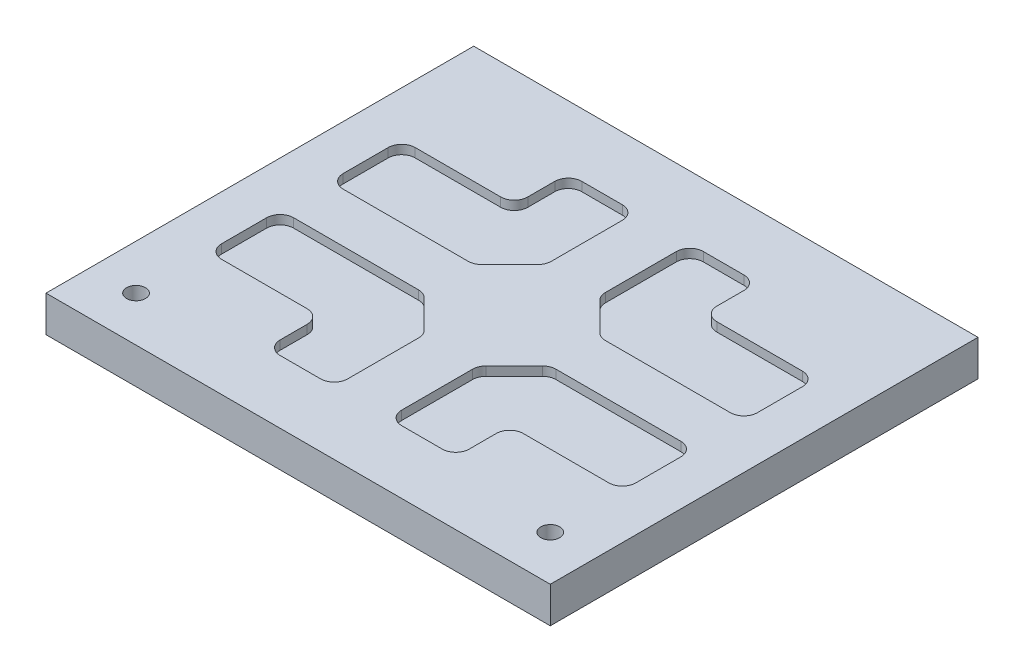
ISO-10303-21;
HEADER;
FILE_DESCRIPTION(('STEP AP214'),'2;1');
FILE_NAME('part.step','',(''),(''),'','','');
FILE_SCHEMA(('AUTOMOTIVE_DESIGN { 1 0 10303 214 1 1 1 1 }'));
ENDSEC;
DATA;
#1=APPLICATION_CONTEXT('core data for automotive mechanical design processes');
#2=APPLICATION_PROTOCOL_DEFINITION('international standard','automotive_design',2000,#1);
#3=PRODUCT_CONTEXT('',#1,'mechanical');
#4=PRODUCT('Part','Part','',(#3));
#5=PRODUCT_RELATED_PRODUCT_CATEGORY('part','',(#4));
#6=PRODUCT_DEFINITION_FORMATION('','',#4);
#7=PRODUCT_DEFINITION_CONTEXT('part definition',#1,'design');
#8=PRODUCT_DEFINITION('design','',#6,#7);
#9=PRODUCT_DEFINITION_SHAPE('','',#8);
#10=(LENGTH_UNIT() NAMED_UNIT(*) SI_UNIT(.MILLI.,.METRE.));
#11=(NAMED_UNIT(*) PLANE_ANGLE_UNIT() SI_UNIT($,.RADIAN.));
#12=(NAMED_UNIT(*) SI_UNIT($,.STERADIAN.) SOLID_ANGLE_UNIT());
#13=UNCERTAINTY_MEASURE_WITH_UNIT(LENGTH_MEASURE(1.E-05),#10,'distance_accuracy_value','');
#14=(GEOMETRIC_REPRESENTATION_CONTEXT(3) GLOBAL_UNCERTAINTY_ASSIGNED_CONTEXT((#13)) GLOBAL_UNIT_ASSIGNED_CONTEXT((#10,
#11,#12)) REPRESENTATION_CONTEXT('',''));
#15=CARTESIAN_POINT('',(0.,0.,0.));
#16=DIRECTION('',(0.,0.,1.));
#17=DIRECTION('',(1.,0.,0.));
#18=AXIS2_PLACEMENT_3D('',#15,#16,#17);
#19=CARTESIAN_POINT('',(280.,40.,237.5));
#20=DIRECTION('',(-1.,0.,0.));
#21=DIRECTION('',(0.,0.,1.));
#22=AXIS2_PLACEMENT_3D('',#19,#20,#21);
#23=PLANE('',#22);
#24=DIRECTION('',(0.,0.,-1.));
#25=VECTOR('',#24,1.);
#26=CARTESIAN_POINT('',(280.,0.,237.5));
#27=LINE('',#26,#25);
#28=CARTESIAN_POINT('',(280.,0.,237.5));
#29=VERTEX_POINT('',#28);
#30=CARTESIAN_POINT('',(280.,0.,-237.5));
#31=VERTEX_POINT('',#30);
#32=EDGE_CURVE('E739',#29,#31,#27,.T.);
#33=ORIENTED_EDGE('',*,*,#32,.T.);
#34=DIRECTION('',(0.,-1.,0.));
#35=VECTOR('',#34,1.);
#36=CARTESIAN_POINT('',(280.,40.,-237.5));
#37=LINE('',#36,#35);
#38=CARTESIAN_POINT('',(280.,40.,-237.5));
#39=VERTEX_POINT('',#38);
#40=EDGE_CURVE('E12',#39,#31,#37,.T.);
#41=ORIENTED_EDGE('',*,*,#40,.F.);
#42=DIRECTION('',(0.,0.,-1.));
#43=VECTOR('',#42,1.);
#44=CARTESIAN_POINT('',(280.,40.,237.5));
#45=LINE('',#44,#43);
#46=CARTESIAN_POINT('',(280.,40.,237.5));
#47=VERTEX_POINT('',#46);
#48=EDGE_CURVE('E723',#47,#39,#45,.T.);
#49=ORIENTED_EDGE('',*,*,#48,.F.);
#50=DIRECTION('',(0.,-1.,0.));
#51=VECTOR('',#50,1.);
#52=CARTESIAN_POINT('',(280.,40.,237.5));
#53=LINE('',#52,#51);
#54=EDGE_CURVE('E738',#47,#29,#53,.T.);
#55=ORIENTED_EDGE('',*,*,#54,.T.);
#56=EDGE_LOOP('',(#33,#41,#49,#55));
#57=FACE_BOUND('',#56,.T.);
#58=ADVANCED_FACE('F41',(#57),#23,.F.);
#59=CARTESIAN_POINT('',(-280.,40.,-237.5));
#60=DIRECTION('',(0.,0.,1.));
#61=DIRECTION('',(1.,0.,0.));
#62=AXIS2_PLACEMENT_3D('',#59,#60,#61);
#63=PLANE('',#62);
#64=DIRECTION('',(-1.,0.,0.));
#65=VECTOR('',#64,1.);
#66=CARTESIAN_POINT('',(-280.,0.,-237.5));
#67=LINE('',#66,#65);
#68=CARTESIAN_POINT('',(-280.,0.,-237.5));
#69=VERTEX_POINT('',#68);
#70=EDGE_CURVE('E742',#31,#69,#67,.T.);
#71=ORIENTED_EDGE('',*,*,#70,.T.);
#72=DIRECTION('',(0.,-1.,0.));
#73=VECTOR('',#72,1.);
#74=CARTESIAN_POINT('',(-280.,40.,-237.5));
#75=LINE('',#74,#73);
#76=CARTESIAN_POINT('',(-280.,40.,-237.5));
#77=VERTEX_POINT('',#76);
#78=EDGE_CURVE('E48',#77,#69,#75,.T.);
#79=ORIENTED_EDGE('',*,*,#78,.F.);
#80=DIRECTION('',(-1.,0.,0.));
#81=VECTOR('',#80,1.);
#82=CARTESIAN_POINT('',(-280.,40.,-237.5));
#83=LINE('',#82,#81);
#84=EDGE_CURVE('E727',#39,#77,#83,.T.);
#85=ORIENTED_EDGE('',*,*,#84,.F.);
#86=ORIENTED_EDGE('',*,*,#40,.T.);
#87=EDGE_LOOP('',(#71,#79,#85,#86));
#88=FACE_BOUND('',#87,.T.);
#89=ADVANCED_FACE('F978',(#88),#63,.F.);
#90=CARTESIAN_POINT('',(-280.,40.,237.5));
#91=DIRECTION('',(1.,0.,0.));
#92=DIRECTION('',(0.,0.,-1.));
#93=AXIS2_PLACEMENT_3D('',#90,#91,#92);
#94=PLANE('',#93);
#95=DIRECTION('',(0.,0.,1.));
#96=VECTOR('',#95,1.);
#97=CARTESIAN_POINT('',(-280.,0.,237.5));
#98=LINE('',#97,#96);
#99=CARTESIAN_POINT('',(-280.,0.,237.5));
#100=VERTEX_POINT('',#99);
#101=EDGE_CURVE('E745',#69,#100,#98,.T.);
#102=ORIENTED_EDGE('',*,*,#101,.T.);
#103=DIRECTION('',(0.,-1.,0.));
#104=VECTOR('',#103,1.);
#105=CARTESIAN_POINT('',(-280.,40.,237.5));
#106=LINE('',#105,#104);
#107=CARTESIAN_POINT('',(-280.,40.,237.5));
#108=VERTEX_POINT('',#107);
#109=EDGE_CURVE('E749',#108,#100,#106,.T.);
#110=ORIENTED_EDGE('',*,*,#109,.F.);
#111=DIRECTION('',(0.,0.,1.));
#112=VECTOR('',#111,1.);
#113=CARTESIAN_POINT('',(-280.,40.,237.5));
#114=LINE('',#113,#112);
#115=EDGE_CURVE('E733',#77,#108,#114,.T.);
#116=ORIENTED_EDGE('',*,*,#115,.F.);
#117=ORIENTED_EDGE('',*,*,#78,.T.);
#118=EDGE_LOOP('',(#102,#110,#116,#117));
#119=FACE_BOUND('',#118,.T.);
#120=ADVANCED_FACE('F983',(#119),#94,.F.);
#121=CARTESIAN_POINT('',(-280.,40.,237.5));
#122=DIRECTION('',(0.,0.,-1.));
#123=DIRECTION('',(-1.,0.,0.));
#124=AXIS2_PLACEMENT_3D('',#121,#122,#123);
#125=PLANE('',#124);
#126=DIRECTION('',(1.,0.,0.));
#127=VECTOR('',#126,1.);
#128=CARTESIAN_POINT('',(-280.,0.,237.5));
#129=LINE('',#128,#127);
#130=EDGE_CURVE('E728',#100,#29,#129,.T.);
#131=ORIENTED_EDGE('',*,*,#130,.T.);
#132=ORIENTED_EDGE('',*,*,#54,.F.);
#133=DIRECTION('',(1.,0.,0.));
#134=VECTOR('',#133,1.);
#135=CARTESIAN_POINT('',(-280.,40.,237.5));
#136=LINE('',#135,#134);
#137=EDGE_CURVE('E735',#108,#47,#136,.T.);
#138=ORIENTED_EDGE('',*,*,#137,.F.);
#139=ORIENTED_EDGE('',*,*,#109,.T.);
#140=EDGE_LOOP('',(#131,#132,#138,#139));
#141=FACE_BOUND('',#140,.T.);
#142=ADVANCED_FACE('F999',(#141),#125,.F.);
#143=CARTESIAN_POINT('',(0.,40.,0.));
#144=DIRECTION('',(0.,-1.,0.));
#145=DIRECTION('',(0.,0.,-1.));
#146=AXIS2_PLACEMENT_3D('',#143,#144,#145);
#147=PLANE('',#146);
#148=CARTESIAN_POINT('',(-230.,40.,187.5));
#149=DIRECTION('',(0.,1.,0.));
#150=DIRECTION('',(0.,0.,1.));
#151=AXIS2_PLACEMENT_3D('',#148,#149,#150);
#152=CIRCLE('',#151,10.5);
#153=CARTESIAN_POINT('',(-230.,40.,198.));
#154=VERTEX_POINT('',#153);
#155=EDGE_CURVE('E766',#154,#154,#152,.T.);
#156=ORIENTED_EDGE('',*,*,#155,.F.);
#157=EDGE_LOOP('',(#156));
#158=FACE_BOUND('',#157,.T.);
#159=CARTESIAN_POINT('',(230.,40.,187.5));
#160=DIRECTION('',(0.,1.,0.));
#161=DIRECTION('',(0.,0.,1.));
#162=AXIS2_PLACEMENT_3D('',#159,#160,#161);
#163=CIRCLE('',#162,10.5);
#164=CARTESIAN_POINT('',(230.,40.,198.));
#165=VERTEX_POINT('',#164);
#166=EDGE_CURVE('E765',#165,#165,#163,.T.);
#167=ORIENTED_EDGE('',*,*,#166,.F.);
#168=EDGE_LOOP('',(#167));
#169=FACE_BOUND('',#168,.T.);
#170=DIRECTION('',(1.,0.,0.));
#171=VECTOR('',#170,1.);
#172=CARTESIAN_POINT('',(215.,40.,107.5));
#173=LINE('',#172,#171);
#174=CARTESIAN_POINT('',(120.,40.,107.5));
#175=VERTEX_POINT('',#174);
#176=CARTESIAN_POINT('',(215.,40.,107.5));
#177=VERTEX_POINT('',#176);
#178=EDGE_CURVE('E1763',#175,#177,#173,.T.);
#179=ORIENTED_EDGE('',*,*,#178,.F.);
#180=CARTESIAN_POINT('',(120.,40.,122.5));
#181=DIRECTION('',(0.,-1.,0.));
#182=DIRECTION('',(0.,0.,1.));
#183=AXIS2_PLACEMENT_3D('',#180,#181,#182);
#184=CIRCLE('',#183,15.);
#185=CARTESIAN_POINT('',(105.,40.,122.5));
#186=VERTEX_POINT('',#185);
#187=EDGE_CURVE('E55',#186,#175,#184,.T.);
#188=ORIENTED_EDGE('',*,*,#187,.F.);
#189=DIRECTION('',(0.,0.,-1.));
#190=VECTOR('',#189,1.);
#191=CARTESIAN_POINT('',(105.,40.,122.5));
#192=LINE('',#191,#190);
#193=CARTESIAN_POINT('',(105.,40.,152.5));
#194=VERTEX_POINT('',#193);
#195=EDGE_CURVE('E654',#194,#186,#192,.T.);
#196=ORIENTED_EDGE('',*,*,#195,.F.);
#197=CARTESIAN_POINT('',(90.0000000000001,40.,152.5));
#198=DIRECTION('',(0.,1.,0.));
#199=DIRECTION('',(0.,0.,-1.));
#200=AXIS2_PLACEMENT_3D('',#197,#198,#199);
#201=CIRCLE('',#200,15.);
#202=CARTESIAN_POINT('',(89.9999999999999,40.,167.5));
#203=VERTEX_POINT('',#202);
#204=EDGE_CURVE('E1910',#203,#194,#201,.T.);
#205=ORIENTED_EDGE('',*,*,#204,.F.);
#206=DIRECTION('',(1.,0.,0.));
#207=VECTOR('',#206,1.);
#208=CARTESIAN_POINT('',(89.9999999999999,40.,167.5));
#209=LINE('',#208,#207);
#210=CARTESIAN_POINT('',(45.0000000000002,40.,167.5));
#211=VERTEX_POINT('',#210);
#212=EDGE_CURVE('E1907',#211,#203,#209,.T.);
#213=ORIENTED_EDGE('',*,*,#212,.F.);
#214=CARTESIAN_POINT('',(45.0000000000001,40.,152.5));
#215=DIRECTION('',(0.,1.,0.));
#216=DIRECTION('',(0.,0.,1.));
#217=AXIS2_PLACEMENT_3D('',#214,#215,#216);
#218=CIRCLE('',#217,15.);
#219=CARTESIAN_POINT('',(30.0000000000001,40.,152.5));
#220=VERTEX_POINT('',#219);
#221=EDGE_CURVE('E1904',#220,#211,#218,.T.);
#222=ORIENTED_EDGE('',*,*,#221,.F.);
#223=DIRECTION('',(0.,0.,1.));
#224=VECTOR('',#223,1.);
#225=CARTESIAN_POINT('',(30.0000000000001,40.,152.5));
#226=LINE('',#225,#224);
#227=CARTESIAN_POINT('',(30.0000000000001,40.,73.7132034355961));
#228=VERTEX_POINT('',#227);
#229=EDGE_CURVE('E1901',#228,#220,#226,.T.);
#230=ORIENTED_EDGE('',*,*,#229,.F.);
#231=CARTESIAN_POINT('',(45.0000000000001,40.,73.7132034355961));
#232=DIRECTION('',(0.,1.,0.));
#233=DIRECTION('',(0.,0.,-1.));
#234=AXIS2_PLACEMENT_3D('',#231,#232,#233);
#235=CIRCLE('',#234,15.);
#236=CARTESIAN_POINT('',(34.3933982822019,40.,63.1066017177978));
#237=VERTEX_POINT('',#236);
#238=EDGE_CURVE('E1898',#237,#228,#235,.T.);
#239=ORIENTED_EDGE('',*,*,#238,.F.);
#240=DIRECTION('',(-0.707106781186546,0.,0.707106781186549));
#241=VECTOR('',#240,1.);
#242=CARTESIAN_POINT('',(34.3933982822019,40.,63.1066017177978));
#243=LINE('',#242,#241);
#244=CARTESIAN_POINT('',(65.6066017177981,40.,31.8933982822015));
#245=VERTEX_POINT('',#244);
#246=EDGE_CURVE('E1895',#245,#237,#243,.T.);
#247=ORIENTED_EDGE('',*,*,#246,.F.);
#248=CARTESIAN_POINT('',(76.2132034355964,40.,42.4999999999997));
#249=DIRECTION('',(0.,1.,0.));
#250=DIRECTION('',(0.,0.,-1.));
#251=AXIS2_PLACEMENT_3D('',#248,#249,#250);
#252=CIRCLE('',#251,15.);
#253=CARTESIAN_POINT('',(76.2132034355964,40.,27.4999999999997));
#254=VERTEX_POINT('',#253);
#255=EDGE_CURVE('E1892',#254,#245,#252,.T.);
#256=ORIENTED_EDGE('',*,*,#255,.F.);
#257=DIRECTION('',(-1.,0.,0.));
#258=VECTOR('',#257,1.);
#259=CARTESIAN_POINT('',(76.2132034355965,40.,27.4999999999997));
#260=LINE('',#259,#258);
#261=CARTESIAN_POINT('',(215.,40.,27.4999999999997));
#262=VERTEX_POINT('',#261);
#263=EDGE_CURVE('E1889',#262,#254,#260,.T.);
#264=ORIENTED_EDGE('',*,*,#263,.F.);
#265=CARTESIAN_POINT('',(215.,40.,42.4999999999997));
#266=DIRECTION('',(0.,1.,0.));
#267=DIRECTION('',(0.,0.,-1.));
#268=AXIS2_PLACEMENT_3D('',#265,#266,#267);
#269=CIRCLE('',#268,15.);
#270=CARTESIAN_POINT('',(230.,40.,42.4999999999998));
#271=VERTEX_POINT('',#270);
#272=EDGE_CURVE('E1886',#271,#262,#269,.T.);
#273=ORIENTED_EDGE('',*,*,#272,.F.);
#274=DIRECTION('',(0.,0.,-1.));
#275=VECTOR('',#274,1.);
#276=CARTESIAN_POINT('',(230.,40.,42.4999999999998));
#277=LINE('',#276,#275);
#278=CARTESIAN_POINT('',(230.,40.,92.4999999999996));
#279=VERTEX_POINT('',#278);
#280=EDGE_CURVE('E1881',#279,#271,#277,.T.);
#281=ORIENTED_EDGE('',*,*,#280,.F.);
#282=CARTESIAN_POINT('',(215.,40.,92.4999999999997));
#283=DIRECTION('',(0.,1.,0.));
#284=DIRECTION('',(0.,0.,-1.));
#285=AXIS2_PLACEMENT_3D('',#282,#283,#284);
#286=CIRCLE('',#285,15.);
#287=EDGE_CURVE('E1879',#177,#279,#286,.T.);
#288=ORIENTED_EDGE('',*,*,#287,.F.);
#289=EDGE_LOOP('',(#179,#188,#196,#205,#213,#222,#230,#239,#247,#256,#264,#273,#281,#288));
#290=FACE_BOUND('',#289,.T.);
#291=DIRECTION('',(0.,0.,-1.));
#292=VECTOR('',#291,1.);
#293=CARTESIAN_POINT('',(105.,40.,-122.5));
#294=LINE('',#293,#292);
#295=CARTESIAN_POINT('',(105.,40.,-122.5));
#296=VERTEX_POINT('',#295);
#297=CARTESIAN_POINT('',(105.,40.,-152.5));
#298=VERTEX_POINT('',#297);
#299=EDGE_CURVE('E583',#296,#298,#294,.T.);
#300=ORIENTED_EDGE('',*,*,#299,.F.);
#301=CARTESIAN_POINT('',(120.,40.,-122.5));
#302=DIRECTION('',(0.,-1.,0.));
#303=DIRECTION('',(0.,0.,-1.));
#304=AXIS2_PLACEMENT_3D('',#301,#302,#303);
#305=CIRCLE('',#304,15.);
#306=CARTESIAN_POINT('',(120.,40.,-107.5));
#307=VERTEX_POINT('',#306);
#308=EDGE_CURVE('E63',#307,#296,#305,.T.);
#309=ORIENTED_EDGE('',*,*,#308,.F.);
#310=DIRECTION('',(-1.,0.,0.));
#311=VECTOR('',#310,1.);
#312=CARTESIAN_POINT('',(215.,40.,-107.5));
#313=LINE('',#312,#311);
#314=CARTESIAN_POINT('',(215.,40.,-107.5));
#315=VERTEX_POINT('',#314);
#316=EDGE_CURVE('E521',#315,#307,#313,.T.);
#317=ORIENTED_EDGE('',*,*,#316,.F.);
#318=CARTESIAN_POINT('',(215.,40.,-92.5000000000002));
#319=DIRECTION('',(0.,1.,0.));
#320=DIRECTION('',(0.,0.,1.));
#321=AXIS2_PLACEMENT_3D('',#318,#319,#320);
#322=CIRCLE('',#321,15.);
#323=CARTESIAN_POINT('',(230.,40.,-92.5000000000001));
#324=VERTEX_POINT('',#323);
#325=EDGE_CURVE('E617',#324,#315,#322,.T.);
#326=ORIENTED_EDGE('',*,*,#325,.F.);
#327=DIRECTION('',(0.,0.,-1.));
#328=VECTOR('',#327,1.);
#329=CARTESIAN_POINT('',(230.,40.,-42.5000000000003));
#330=LINE('',#329,#328);
#331=CARTESIAN_POINT('',(230.,40.,-42.5000000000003));
#332=VERTEX_POINT('',#331);
#333=EDGE_CURVE('E614',#332,#324,#330,.T.);
#334=ORIENTED_EDGE('',*,*,#333,.F.);
#335=CARTESIAN_POINT('',(215.,40.,-42.5000000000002));
#336=DIRECTION('',(0.,1.,0.));
#337=DIRECTION('',(0.,0.,1.));
#338=AXIS2_PLACEMENT_3D('',#335,#336,#337);
#339=CIRCLE('',#338,15.);
#340=CARTESIAN_POINT('',(215.,40.,-27.5000000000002));
#341=VERTEX_POINT('',#340);
#342=EDGE_CURVE('E611',#341,#332,#339,.T.);
#343=ORIENTED_EDGE('',*,*,#342,.F.);
#344=DIRECTION('',(1.,0.,0.));
#345=VECTOR('',#344,1.);
#346=CARTESIAN_POINT('',(76.2132034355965,40.,-27.5000000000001));
#347=LINE('',#346,#345);
#348=CARTESIAN_POINT('',(76.2132034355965,40.,-27.5000000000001));
#349=VERTEX_POINT('',#348);
#350=EDGE_CURVE('E608',#349,#341,#347,.T.);
#351=ORIENTED_EDGE('',*,*,#350,.F.);
#352=CARTESIAN_POINT('',(76.2132034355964,40.,-42.5000000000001));
#353=DIRECTION('',(0.,1.,0.));
#354=DIRECTION('',(0.,0.,1.));
#355=AXIS2_PLACEMENT_3D('',#352,#353,#354);
#356=CIRCLE('',#355,15.);
#357=CARTESIAN_POINT('',(65.6066017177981,40.,-31.893398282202));
#358=VERTEX_POINT('',#357);
#359=EDGE_CURVE('E605',#358,#349,#356,.T.);
#360=ORIENTED_EDGE('',*,*,#359,.F.);
#361=DIRECTION('',(0.707106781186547,0.,0.707106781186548));
#362=VECTOR('',#361,1.);
#363=CARTESIAN_POINT('',(34.3933982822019,40.,-63.1066017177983));
#364=LINE('',#363,#362);
#365=CARTESIAN_POINT('',(34.3933982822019,40.,-63.1066017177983));
#366=VERTEX_POINT('',#365);
#367=EDGE_CURVE('E602',#366,#358,#364,.T.);
#368=ORIENTED_EDGE('',*,*,#367,.F.);
#369=CARTESIAN_POINT('',(45.,40.,-73.7132034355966));
#370=DIRECTION('',(0.,1.,0.));
#371=DIRECTION('',(0.,0.,1.));
#372=AXIS2_PLACEMENT_3D('',#369,#370,#371);
#373=CIRCLE('',#372,15.);
#374=CARTESIAN_POINT('',(30.,40.,-73.7132034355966));
#375=VERTEX_POINT('',#374);
#376=EDGE_CURVE('E599',#375,#366,#373,.T.);
#377=ORIENTED_EDGE('',*,*,#376,.F.);
#378=DIRECTION('',(0.,0.,1.));
#379=VECTOR('',#378,1.);
#380=CARTESIAN_POINT('',(29.9999999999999,40.,-152.5));
#381=LINE('',#380,#379);
#382=CARTESIAN_POINT('',(29.9999999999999,40.,-152.5));
#383=VERTEX_POINT('',#382);
#384=EDGE_CURVE('E596',#383,#375,#381,.T.);
#385=ORIENTED_EDGE('',*,*,#384,.F.);
#386=CARTESIAN_POINT('',(45.,40.,-152.5));
#387=DIRECTION('',(0.,1.,0.));
#388=DIRECTION('',(0.,0.,-1.));
#389=AXIS2_PLACEMENT_3D('',#386,#387,#388);
#390=CIRCLE('',#389,15.);
#391=CARTESIAN_POINT('',(45.,40.,-167.5));
#392=VERTEX_POINT('',#391);
#393=EDGE_CURVE('E593',#392,#383,#390,.T.);
#394=ORIENTED_EDGE('',*,*,#393,.F.);
#395=DIRECTION('',(-1.,0.,0.));
#396=VECTOR('',#395,1.);
#397=CARTESIAN_POINT('',(89.9999999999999,40.,-167.5));
#398=LINE('',#397,#396);
#399=CARTESIAN_POINT('',(89.9999999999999,40.,-167.5));
#400=VERTEX_POINT('',#399);
#401=EDGE_CURVE('E590',#400,#392,#398,.T.);
#402=ORIENTED_EDGE('',*,*,#401,.F.);
#403=CARTESIAN_POINT('',(90.,40.,-152.5));
#404=DIRECTION('',(0.,1.,0.));
#405=DIRECTION('',(0.,0.,1.));
#406=AXIS2_PLACEMENT_3D('',#403,#404,#405);
#407=CIRCLE('',#406,15.);
#408=EDGE_CURVE('E587',#298,#400,#407,.T.);
#409=ORIENTED_EDGE('',*,*,#408,.F.);
#410=EDGE_LOOP('',(#300,#309,#317,#326,#334,#343,#351,#360,#368,#377,#385,#394,#402,#409));
#411=FACE_BOUND('',#410,.T.);
#412=DIRECTION('',(-1.,0.,0.));
#413=VECTOR('',#412,1.);
#414=CARTESIAN_POINT('',(-215.,40.,-107.5));
#415=LINE('',#414,#413);
#416=CARTESIAN_POINT('',(-120.,40.,-107.5));
#417=VERTEX_POINT('',#416);
#418=CARTESIAN_POINT('',(-215.,40.,-107.5));
#419=VERTEX_POINT('',#418);
#420=EDGE_CURVE('E1768',#417,#419,#415,.T.);
#421=ORIENTED_EDGE('',*,*,#420,.F.);
#422=CARTESIAN_POINT('',(-120.,40.,-122.5));
#423=DIRECTION('',(0.,-1.,0.));
#424=DIRECTION('',(0.,0.,1.));
#425=AXIS2_PLACEMENT_3D('',#422,#423,#424);
#426=CIRCLE('',#425,15.);
#427=CARTESIAN_POINT('',(-105.,40.,-122.5));
#428=VERTEX_POINT('',#427);
#429=EDGE_CURVE('E424',#428,#417,#426,.T.);
#430=ORIENTED_EDGE('',*,*,#429,.F.);
#431=DIRECTION('',(0.,0.,1.));
#432=VECTOR('',#431,1.);
#433=CARTESIAN_POINT('',(-105.,40.,-122.5));
#434=LINE('',#433,#432);
#435=CARTESIAN_POINT('',(-105.,40.,-152.5));
#436=VERTEX_POINT('',#435);
#437=EDGE_CURVE('E442',#436,#428,#434,.T.);
#438=ORIENTED_EDGE('',*,*,#437,.F.);
#439=CARTESIAN_POINT('',(-89.9999999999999,40.,-152.5));
#440=DIRECTION('',(0.,1.,0.));
#441=DIRECTION('',(0.,0.,-1.));
#442=AXIS2_PLACEMENT_3D('',#439,#440,#441);
#443=CIRCLE('',#442,15.);
#444=CARTESIAN_POINT('',(-89.9999999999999,40.,-167.5));
#445=VERTEX_POINT('',#444);
#446=EDGE_CURVE('E445',#445,#436,#443,.T.);
#447=ORIENTED_EDGE('',*,*,#446,.F.);
#448=DIRECTION('',(-1.,0.,0.));
#449=VECTOR('',#448,1.);
#450=CARTESIAN_POINT('',(-89.9999999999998,40.,-167.5));
#451=LINE('',#450,#449);
#452=CARTESIAN_POINT('',(-45.,40.,-167.5));
#453=VERTEX_POINT('',#452);
#454=EDGE_CURVE('E1800',#453,#445,#451,.T.);
#455=ORIENTED_EDGE('',*,*,#454,.F.);
#456=CARTESIAN_POINT('',(-44.9999999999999,40.,-152.5));
#457=DIRECTION('',(0.,1.,0.));
#458=DIRECTION('',(0.,0.,1.));
#459=AXIS2_PLACEMENT_3D('',#456,#457,#458);
#460=CIRCLE('',#459,15.);
#461=CARTESIAN_POINT('',(-29.9999999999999,40.,-152.5));
#462=VERTEX_POINT('',#461);
#463=EDGE_CURVE('E1797',#462,#453,#460,.T.);
#464=ORIENTED_EDGE('',*,*,#463,.F.);
#465=DIRECTION('',(0.,0.,-1.));
#466=VECTOR('',#465,1.);
#467=CARTESIAN_POINT('',(-29.9999999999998,40.,-152.5));
#468=LINE('',#467,#466);
#469=CARTESIAN_POINT('',(-30.,40.,-73.7132034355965));
#470=VERTEX_POINT('',#469);
#471=EDGE_CURVE('E1794',#470,#462,#468,.T.);
#472=ORIENTED_EDGE('',*,*,#471,.F.);
#473=CARTESIAN_POINT('',(-44.9999999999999,40.,-73.7132034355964));
#474=DIRECTION('',(0.,1.,0.));
#475=DIRECTION('',(0.,0.,-1.));
#476=AXIS2_PLACEMENT_3D('',#473,#474,#475);
#477=CIRCLE('',#476,15.);
#478=CARTESIAN_POINT('',(-34.3933982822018,40.,-63.1066017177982));
#479=VERTEX_POINT('',#478);
#480=EDGE_CURVE('E1791',#479,#470,#477,.T.);
#481=ORIENTED_EDGE('',*,*,#480,.F.);
#482=DIRECTION('',(0.707106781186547,0.,-0.707106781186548));
#483=VECTOR('',#482,1.);
#484=CARTESIAN_POINT('',(-34.3933982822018,40.,-63.1066017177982));
#485=LINE('',#484,#483);
#486=CARTESIAN_POINT('',(-65.606601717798,40.,-31.8933982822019));
#487=VERTEX_POINT('',#486);
#488=EDGE_CURVE('E1788',#487,#479,#485,.T.);
#489=ORIENTED_EDGE('',*,*,#488,.F.);
#490=CARTESIAN_POINT('',(-76.2132034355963,40.,-42.5));
#491=DIRECTION('',(0.,1.,0.));
#492=DIRECTION('',(0.,0.,-1.));
#493=AXIS2_PLACEMENT_3D('',#490,#491,#492);
#494=CIRCLE('',#493,15.);
#495=CARTESIAN_POINT('',(-76.2132034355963,40.,-27.5));
#496=VERTEX_POINT('',#495);
#497=EDGE_CURVE('E1785',#496,#487,#494,.T.);
#498=ORIENTED_EDGE('',*,*,#497,.F.);
#499=DIRECTION('',(1.,0.,0.));
#500=VECTOR('',#499,1.);
#501=CARTESIAN_POINT('',(-76.2132034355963,40.,-27.5));
#502=LINE('',#501,#500);
#503=CARTESIAN_POINT('',(-215.,40.,-27.5000000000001));
#504=VERTEX_POINT('',#503);
#505=EDGE_CURVE('E1782',#504,#496,#502,.T.);
#506=ORIENTED_EDGE('',*,*,#505,.F.);
#507=CARTESIAN_POINT('',(-215.,40.,-42.5000000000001));
#508=DIRECTION('',(0.,1.,0.));
#509=DIRECTION('',(0.,0.,-1.));
#510=AXIS2_PLACEMENT_3D('',#507,#508,#509);
#511=CIRCLE('',#510,15.);
#512=CARTESIAN_POINT('',(-230.,40.,-42.5000000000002));
#513=VERTEX_POINT('',#512);
#514=EDGE_CURVE('E1779',#513,#504,#511,.T.);
#515=ORIENTED_EDGE('',*,*,#514,.F.);
#516=DIRECTION('',(0.,0.,1.));
#517=VECTOR('',#516,1.);
#518=CARTESIAN_POINT('',(-230.,40.,-42.5000000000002));
#519=LINE('',#518,#517);
#520=CARTESIAN_POINT('',(-230.,40.,-92.5));
#521=VERTEX_POINT('',#520);
#522=EDGE_CURVE('E1774',#521,#513,#519,.T.);
#523=ORIENTED_EDGE('',*,*,#522,.F.);
#524=CARTESIAN_POINT('',(-215.,40.,-92.5000000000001));
#525=DIRECTION('',(0.,1.,0.));
#526=DIRECTION('',(0.,0.,-1.));
#527=AXIS2_PLACEMENT_3D('',#524,#525,#526);
#528=CIRCLE('',#527,15.);
#529=EDGE_CURVE('E1772',#419,#521,#528,.T.);
#530=ORIENTED_EDGE('',*,*,#529,.F.);
#531=EDGE_LOOP('',(#421,#430,#438,#447,#455,#464,#472,#481,#489,#498,#506,#515,#523,#530));
#532=FACE_BOUND('',#531,.T.);
#533=DIRECTION('',(0.,0.,1.));
#534=VECTOR('',#533,1.);
#535=CARTESIAN_POINT('',(-105.,40.,122.5));
#536=LINE('',#535,#534);
#537=CARTESIAN_POINT('',(-105.,40.,122.5));
#538=VERTEX_POINT('',#537);
#539=CARTESIAN_POINT('',(-105.,40.,152.5));
#540=VERTEX_POINT('',#539);
#541=EDGE_CURVE('E842',#538,#540,#536,.T.);
#542=ORIENTED_EDGE('',*,*,#541,.F.);
#543=CARTESIAN_POINT('',(-120.,40.,122.5));
#544=DIRECTION('',(0.,-1.,0.));
#545=DIRECTION('',(0.,0.,-1.));
#546=AXIS2_PLACEMENT_3D('',#543,#544,#545);
#547=CIRCLE('',#546,15.);
#548=CARTESIAN_POINT('',(-120.,40.,107.5));
#549=VERTEX_POINT('',#548);
#550=EDGE_CURVE('E840',#549,#538,#547,.T.);
#551=ORIENTED_EDGE('',*,*,#550,.F.);
#552=DIRECTION('',(1.,0.,0.));
#553=VECTOR('',#552,1.);
#554=CARTESIAN_POINT('',(-215.,40.,107.5));
#555=LINE('',#554,#553);
#556=CARTESIAN_POINT('',(-215.,40.,107.5));
#557=VERTEX_POINT('',#556);
#558=EDGE_CURVE('E781',#557,#549,#555,.T.);
#559=ORIENTED_EDGE('',*,*,#558,.F.);
#560=CARTESIAN_POINT('',(-215.,40.,92.4999999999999));
#561=DIRECTION('',(0.,1.,0.));
#562=DIRECTION('',(0.,0.,1.));
#563=AXIS2_PLACEMENT_3D('',#560,#561,#562);
#564=CIRCLE('',#563,15.);
#565=CARTESIAN_POINT('',(-230.,40.,92.4999999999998));
#566=VERTEX_POINT('',#565);
#567=EDGE_CURVE('E876',#566,#557,#564,.T.);
#568=ORIENTED_EDGE('',*,*,#567,.F.);
#569=DIRECTION('',(0.,0.,1.));
#570=VECTOR('',#569,1.);
#571=CARTESIAN_POINT('',(-230.,40.,42.5));
#572=LINE('',#571,#570);
#573=CARTESIAN_POINT('',(-230.,40.,42.5));
#574=VERTEX_POINT('',#573);
#575=EDGE_CURVE('E873',#574,#566,#572,.T.);
#576=ORIENTED_EDGE('',*,*,#575,.F.);
#577=CARTESIAN_POINT('',(-215.,40.,42.4999999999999));
#578=DIRECTION('',(0.,1.,0.));
#579=DIRECTION('',(0.,0.,1.));
#580=AXIS2_PLACEMENT_3D('',#577,#578,#579);
#581=CIRCLE('',#580,15.);
#582=CARTESIAN_POINT('',(-215.,40.,27.4999999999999));
#583=VERTEX_POINT('',#582);
#584=EDGE_CURVE('E870',#583,#574,#581,.T.);
#585=ORIENTED_EDGE('',*,*,#584,.F.);
#586=DIRECTION('',(-1.,0.,0.));
#587=VECTOR('',#586,1.);
#588=CARTESIAN_POINT('',(-76.2132034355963,40.,27.4999999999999));
#589=LINE('',#588,#587);
#590=CARTESIAN_POINT('',(-76.2132034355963,40.,27.4999999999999));
#591=VERTEX_POINT('',#590);
#592=EDGE_CURVE('E867',#591,#583,#589,.T.);
#593=ORIENTED_EDGE('',*,*,#592,.F.);
#594=CARTESIAN_POINT('',(-76.2132034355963,40.,42.4999999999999));
#595=DIRECTION('',(0.,1.,0.));
#596=DIRECTION('',(0.,0.,1.));
#597=AXIS2_PLACEMENT_3D('',#594,#595,#596);
#598=CIRCLE('',#597,15.);
#599=CARTESIAN_POINT('',(-65.606601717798,40.,31.8933982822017));
#600=VERTEX_POINT('',#599);
#601=EDGE_CURVE('E864',#600,#591,#598,.T.);
#602=ORIENTED_EDGE('',*,*,#601,.F.);
#603=DIRECTION('',(-0.707106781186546,0.,-0.707106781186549));
#604=VECTOR('',#603,1.);
#605=CARTESIAN_POINT('',(-34.3933982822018,40.,63.1066017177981));
#606=LINE('',#605,#604);
#607=CARTESIAN_POINT('',(-34.3933982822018,40.,63.1066017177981));
#608=VERTEX_POINT('',#607);
#609=EDGE_CURVE('E861',#608,#600,#606,.T.);
#610=ORIENTED_EDGE('',*,*,#609,.F.);
#611=CARTESIAN_POINT('',(-45.,40.,73.7132034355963));
#612=DIRECTION('',(0.,1.,0.));
#613=DIRECTION('',(0.,0.,1.));
#614=AXIS2_PLACEMENT_3D('',#611,#612,#613);
#615=CIRCLE('',#614,15.);
#616=CARTESIAN_POINT('',(-30.,40.,73.7132034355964));
#617=VERTEX_POINT('',#616);
#618=EDGE_CURVE('E858',#617,#608,#615,.T.);
#619=ORIENTED_EDGE('',*,*,#618,.F.);
#620=DIRECTION('',(0.,0.,-1.));
#621=VECTOR('',#620,1.);
#622=CARTESIAN_POINT('',(-29.9999999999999,40.,152.5));
#623=LINE('',#622,#621);
#624=CARTESIAN_POINT('',(-29.9999999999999,40.,152.5));
#625=VERTEX_POINT('',#624);
#626=EDGE_CURVE('E855',#625,#617,#623,.T.);
#627=ORIENTED_EDGE('',*,*,#626,.F.);
#628=CARTESIAN_POINT('',(-44.9999999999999,40.,152.5));
#629=DIRECTION('',(0.,1.,0.));
#630=DIRECTION('',(0.,0.,-1.));
#631=AXIS2_PLACEMENT_3D('',#628,#629,#630);
#632=CIRCLE('',#631,15.);
#633=CARTESIAN_POINT('',(-45.,40.,167.5));
#634=VERTEX_POINT('',#633);
#635=EDGE_CURVE('E852',#634,#625,#632,.T.);
#636=ORIENTED_EDGE('',*,*,#635,.F.);
#637=DIRECTION('',(1.,0.,0.));
#638=VECTOR('',#637,1.);
#639=CARTESIAN_POINT('',(-89.9999999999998,40.,167.5));
#640=LINE('',#639,#638);
#641=CARTESIAN_POINT('',(-89.9999999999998,40.,167.5));
#642=VERTEX_POINT('',#641);
#643=EDGE_CURVE('E849',#642,#634,#640,.T.);
#644=ORIENTED_EDGE('',*,*,#643,.F.);
#645=CARTESIAN_POINT('',(-89.9999999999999,40.,152.5));
#646=DIRECTION('',(0.,1.,0.));
#647=DIRECTION('',(0.,0.,1.));
#648=AXIS2_PLACEMENT_3D('',#645,#646,#647);
#649=CIRCLE('',#648,15.);
#650=EDGE_CURVE('E846',#540,#642,#649,.T.);
#651=ORIENTED_EDGE('',*,*,#650,.F.);
#652=EDGE_LOOP('',(#542,#551,#559,#568,#576,#585,#593,#602,#610,#619,#627,#636,#644,#651));
#653=FACE_BOUND('',#652,.T.);
#654=ORIENTED_EDGE('',*,*,#48,.T.);
#655=ORIENTED_EDGE('',*,*,#84,.T.);
#656=ORIENTED_EDGE('',*,*,#115,.T.);
#657=ORIENTED_EDGE('',*,*,#137,.T.);
#658=EDGE_LOOP('',(#654,#655,#656,#657));
#659=FACE_BOUND('',#658,.T.);
#660=ADVANCED_FACE('F916',(#158,#169,#290,#411,#532,#653,#659),#147,.F.);
#661=CARTESIAN_POINT('',(0.,0.,0.));
#662=DIRECTION('',(0.,-1.,0.));
#663=DIRECTION('',(0.,0.,-1.));
#664=AXIS2_PLACEMENT_3D('',#661,#662,#663);
#665=PLANE('',#664);
#666=CARTESIAN_POINT('',(-230.,0.,187.5));
#667=DIRECTION('',(0.,1.,0.));
#668=DIRECTION('',(0.,0.,1.));
#669=AXIS2_PLACEMENT_3D('',#666,#667,#668);
#670=CIRCLE('',#669,10.5);
#671=CARTESIAN_POINT('',(-230.,0.,198.));
#672=VERTEX_POINT('',#671);
#673=EDGE_CURVE('E762',#672,#672,#670,.T.);
#674=ORIENTED_EDGE('',*,*,#673,.T.);
#675=EDGE_LOOP('',(#674));
#676=FACE_BOUND('',#675,.T.);
#677=CARTESIAN_POINT('',(230.,0.,187.5));
#678=DIRECTION('',(0.,1.,0.));
#679=DIRECTION('',(0.,0.,1.));
#680=AXIS2_PLACEMENT_3D('',#677,#678,#679);
#681=CIRCLE('',#680,10.5);
#682=CARTESIAN_POINT('',(230.,0.,198.));
#683=VERTEX_POINT('',#682);
#684=EDGE_CURVE('E449',#683,#683,#681,.T.);
#685=ORIENTED_EDGE('',*,*,#684,.T.);
#686=EDGE_LOOP('',(#685));
#687=FACE_BOUND('',#686,.T.);
#688=ORIENTED_EDGE('',*,*,#32,.F.);
#689=ORIENTED_EDGE('',*,*,#130,.F.);
#690=ORIENTED_EDGE('',*,*,#101,.F.);
#691=ORIENTED_EDGE('',*,*,#70,.F.);
#692=EDGE_LOOP('',(#688,#689,#690,#691));
#693=FACE_BOUND('',#692,.T.);
#694=ADVANCED_FACE('F991',(#676,#687,#693),#665,.T.);
#695=CARTESIAN_POINT('',(-120.,30.,122.5));
#696=DIRECTION('',(0.,1.,0.));
#697=DIRECTION('',(0.,0.,1.));
#698=AXIS2_PLACEMENT_3D('',#695,#696,#697);
#699=CYLINDRICAL_SURFACE('',#698,15.);
#700=ORIENTED_EDGE('',*,*,#550,.T.);
#701=DIRECTION('',(0.,1.,0.));
#702=VECTOR('',#701,1.);
#703=CARTESIAN_POINT('',(-105.,30.,122.5));
#704=LINE('',#703,#702);
#705=CARTESIAN_POINT('',(-105.,30.,122.5));
#706=VERTEX_POINT('',#705);
#707=EDGE_CURVE('E729',#706,#538,#704,.T.);
#708=ORIENTED_EDGE('',*,*,#707,.F.);
#709=CARTESIAN_POINT('',(-120.,30.,122.5));
#710=DIRECTION('',(0.,-1.,0.));
#711=DIRECTION('',(0.,0.,-1.));
#712=AXIS2_PLACEMENT_3D('',#709,#710,#711);
#713=CIRCLE('',#712,15.);
#714=CARTESIAN_POINT('',(-120.,30.,107.5));
#715=VERTEX_POINT('',#714);
#716=EDGE_CURVE('E776',#715,#706,#713,.T.);
#717=ORIENTED_EDGE('',*,*,#716,.F.);
#718=DIRECTION('',(0.,1.,0.));
#719=VECTOR('',#718,1.);
#720=CARTESIAN_POINT('',(-120.,30.,107.5));
#721=LINE('',#720,#719);
#722=EDGE_CURVE('E743',#715,#549,#721,.T.);
#723=ORIENTED_EDGE('',*,*,#722,.T.);
#724=EDGE_LOOP('',(#700,#708,#717,#723));
#725=FACE_BOUND('',#724,.T.);
#726=ADVANCED_FACE('F930',(#725),#699,.T.);
#727=CARTESIAN_POINT('',(-215.,30.,107.5));
#728=DIRECTION('',(0.,0.,1.));
#729=DIRECTION('',(1.,0.,0.));
#730=AXIS2_PLACEMENT_3D('',#727,#728,#729);
#731=PLANE('',#730);
#732=ORIENTED_EDGE('',*,*,#558,.T.);
#733=ORIENTED_EDGE('',*,*,#722,.F.);
#734=DIRECTION('',(1.,0.,0.));
#735=VECTOR('',#734,1.);
#736=CARTESIAN_POINT('',(-215.,30.,107.5));
#737=LINE('',#736,#735);
#738=CARTESIAN_POINT('',(-215.,30.,107.5));
#739=VERTEX_POINT('',#738);
#740=EDGE_CURVE('E836',#739,#715,#737,.T.);
#741=ORIENTED_EDGE('',*,*,#740,.F.);
#742=DIRECTION('',(0.,1.,0.));
#743=VECTOR('',#742,1.);
#744=CARTESIAN_POINT('',(-215.,30.,107.5));
#745=LINE('',#744,#743);
#746=EDGE_CURVE('E882',#739,#557,#745,.T.);
#747=ORIENTED_EDGE('',*,*,#746,.T.);
#748=EDGE_LOOP('',(#732,#733,#741,#747));
#749=FACE_BOUND('',#748,.T.);
#750=ADVANCED_FACE('F932',(#749),#731,.F.);
#751=CARTESIAN_POINT('',(-215.,30.,92.4999999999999));
#752=DIRECTION('',(0.,1.,0.));
#753=DIRECTION('',(0.,0.,1.));
#754=AXIS2_PLACEMENT_3D('',#751,#752,#753);
#755=CYLINDRICAL_SURFACE('',#754,15.);
#756=ORIENTED_EDGE('',*,*,#567,.T.);
#757=ORIENTED_EDGE('',*,*,#746,.F.);
#758=CARTESIAN_POINT('',(-215.,30.,92.4999999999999));
#759=DIRECTION('',(0.,1.,0.));
#760=DIRECTION('',(0.,0.,1.));
#761=AXIS2_PLACEMENT_3D('',#758,#759,#760);
#762=CIRCLE('',#761,15.);
#763=CARTESIAN_POINT('',(-230.,30.,92.4999999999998));
#764=VERTEX_POINT('',#763);
#765=EDGE_CURVE('E833',#764,#739,#762,.T.);
#766=ORIENTED_EDGE('',*,*,#765,.F.);
#767=DIRECTION('',(0.,1.,0.));
#768=VECTOR('',#767,1.);
#769=CARTESIAN_POINT('',(-230.,30.,92.4999999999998));
#770=LINE('',#769,#768);
#771=EDGE_CURVE('E884',#764,#566,#770,.T.);
#772=ORIENTED_EDGE('',*,*,#771,.T.);
#773=EDGE_LOOP('',(#756,#757,#766,#772));
#774=FACE_BOUND('',#773,.T.);
#775=ADVANCED_FACE('F937',(#774),#755,.F.);
#776=CARTESIAN_POINT('',(-230.,30.,42.5));
#777=DIRECTION('',(-1.,0.,0.));
#778=DIRECTION('',(0.,0.,1.));
#779=AXIS2_PLACEMENT_3D('',#776,#777,#778);
#780=PLANE('',#779);
#781=ORIENTED_EDGE('',*,*,#575,.T.);
#782=ORIENTED_EDGE('',*,*,#771,.F.);
#783=DIRECTION('',(0.,0.,1.));
#784=VECTOR('',#783,1.);
#785=CARTESIAN_POINT('',(-230.,30.,42.5));
#786=LINE('',#785,#784);
#787=CARTESIAN_POINT('',(-230.,30.,42.5));
#788=VERTEX_POINT('',#787);
#789=EDGE_CURVE('E829',#788,#764,#786,.T.);
#790=ORIENTED_EDGE('',*,*,#789,.F.);
#791=DIRECTION('',(0.,1.,0.));
#792=VECTOR('',#791,1.);
#793=CARTESIAN_POINT('',(-230.,30.,42.5));
#794=LINE('',#793,#792);
#795=EDGE_CURVE('E886',#788,#574,#794,.T.);
#796=ORIENTED_EDGE('',*,*,#795,.T.);
#797=EDGE_LOOP('',(#781,#782,#790,#796));
#798=FACE_BOUND('',#797,.T.);
#799=ADVANCED_FACE('F942',(#798),#780,.F.);
#800=CARTESIAN_POINT('',(-215.,30.,42.4999999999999));
#801=DIRECTION('',(0.,1.,0.));
#802=DIRECTION('',(0.,0.,1.));
#803=AXIS2_PLACEMENT_3D('',#800,#801,#802);
#804=CYLINDRICAL_SURFACE('',#803,15.);
#805=ORIENTED_EDGE('',*,*,#584,.T.);
#806=ORIENTED_EDGE('',*,*,#795,.F.);
#807=CARTESIAN_POINT('',(-215.,30.,42.4999999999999));
#808=DIRECTION('',(0.,1.,0.));
#809=DIRECTION('',(0.,0.,1.));
#810=AXIS2_PLACEMENT_3D('',#807,#808,#809);
#811=CIRCLE('',#810,15.);
#812=CARTESIAN_POINT('',(-215.,30.,27.4999999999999));
#813=VERTEX_POINT('',#812);
#814=EDGE_CURVE('E825',#813,#788,#811,.T.);
#815=ORIENTED_EDGE('',*,*,#814,.F.);
#816=DIRECTION('',(0.,1.,0.));
#817=VECTOR('',#816,1.);
#818=CARTESIAN_POINT('',(-215.,30.,27.4999999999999));
#819=LINE('',#818,#817);
#820=EDGE_CURVE('E888',#813,#583,#819,.T.);
#821=ORIENTED_EDGE('',*,*,#820,.T.);
#822=EDGE_LOOP('',(#805,#806,#815,#821));
#823=FACE_BOUND('',#822,.T.);
#824=ADVANCED_FACE('F945',(#823),#804,.F.);
#825=CARTESIAN_POINT('',(-76.2132034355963,30.,27.4999999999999));
#826=DIRECTION('',(0.,0.,-1.));
#827=DIRECTION('',(-1.,0.,0.));
#828=AXIS2_PLACEMENT_3D('',#825,#826,#827);
#829=PLANE('',#828);
#830=ORIENTED_EDGE('',*,*,#592,.T.);
#831=ORIENTED_EDGE('',*,*,#820,.F.);
#832=DIRECTION('',(-1.,0.,0.));
#833=VECTOR('',#832,1.);
#834=CARTESIAN_POINT('',(-76.2132034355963,30.,27.4999999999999));
#835=LINE('',#834,#833);
#836=CARTESIAN_POINT('',(-76.2132034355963,30.,27.4999999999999));
#837=VERTEX_POINT('',#836);
#838=EDGE_CURVE('E821',#837,#813,#835,.T.);
#839=ORIENTED_EDGE('',*,*,#838,.F.);
#840=DIRECTION('',(0.,1.,0.));
#841=VECTOR('',#840,1.);
#842=CARTESIAN_POINT('',(-76.2132034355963,30.,27.4999999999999));
#843=LINE('',#842,#841);
#844=EDGE_CURVE('E890',#837,#591,#843,.T.);
#845=ORIENTED_EDGE('',*,*,#844,.T.);
#846=EDGE_LOOP('',(#830,#831,#839,#845));
#847=FACE_BOUND('',#846,.T.);
#848=ADVANCED_FACE('F950',(#847),#829,.F.);
#849=CARTESIAN_POINT('',(-76.2132034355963,30.,42.4999999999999));
#850=DIRECTION('',(0.,1.,0.));
#851=DIRECTION('',(0.,0.,1.));
#852=AXIS2_PLACEMENT_3D('',#849,#850,#851);
#853=CYLINDRICAL_SURFACE('',#852,15.);
#854=ORIENTED_EDGE('',*,*,#601,.T.);
#855=ORIENTED_EDGE('',*,*,#844,.F.);
#856=CARTESIAN_POINT('',(-76.2132034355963,30.,42.4999999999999));
#857=DIRECTION('',(0.,1.,0.));
#858=DIRECTION('',(0.,0.,1.));
#859=AXIS2_PLACEMENT_3D('',#856,#857,#858);
#860=CIRCLE('',#859,15.);
#861=CARTESIAN_POINT('',(-65.606601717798,30.,31.8933982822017));
#862=VERTEX_POINT('',#861);
#863=EDGE_CURVE('E818',#862,#837,#860,.T.);
#864=ORIENTED_EDGE('',*,*,#863,.F.);
#865=DIRECTION('',(0.,1.,0.));
#866=VECTOR('',#865,1.);
#867=CARTESIAN_POINT('',(-65.606601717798,30.,31.8933982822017));
#868=LINE('',#867,#866);
#869=EDGE_CURVE('E892',#862,#600,#868,.T.);
#870=ORIENTED_EDGE('',*,*,#869,.T.);
#871=EDGE_LOOP('',(#854,#855,#864,#870));
#872=FACE_BOUND('',#871,.T.);
#873=ADVANCED_FACE('F954',(#872),#853,.F.);
#874=CARTESIAN_POINT('',(-34.3933982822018,30.,63.1066017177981));
#875=DIRECTION('',(0.707106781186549,0.,-0.707106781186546));
#876=DIRECTION('',(-0.707106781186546,0.,-0.707106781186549));
#877=AXIS2_PLACEMENT_3D('',#874,#875,#876);
#878=PLANE('',#877);
#879=ORIENTED_EDGE('',*,*,#609,.T.);
#880=ORIENTED_EDGE('',*,*,#869,.F.);
#881=DIRECTION('',(-0.707106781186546,0.,-0.707106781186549));
#882=VECTOR('',#881,1.);
#883=CARTESIAN_POINT('',(-34.3933982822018,30.,63.1066017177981));
#884=LINE('',#883,#882);
#885=CARTESIAN_POINT('',(-34.3933982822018,30.,63.1066017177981));
#886=VERTEX_POINT('',#885);
#887=EDGE_CURVE('E810',#886,#862,#884,.T.);
#888=ORIENTED_EDGE('',*,*,#887,.F.);
#889=DIRECTION('',(0.,1.,0.));
#890=VECTOR('',#889,1.);
#891=CARTESIAN_POINT('',(-34.3933982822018,30.,63.1066017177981));
#892=LINE('',#891,#890);
#893=EDGE_CURVE('E894',#886,#608,#892,.T.);
#894=ORIENTED_EDGE('',*,*,#893,.T.);
#895=EDGE_LOOP('',(#879,#880,#888,#894));
#896=FACE_BOUND('',#895,.T.);
#897=ADVANCED_FACE('F958',(#896),#878,.F.);
#898=CARTESIAN_POINT('',(-45.,30.,73.7132034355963));
#899=DIRECTION('',(0.,1.,0.));
#900=DIRECTION('',(0.,0.,1.));
#901=AXIS2_PLACEMENT_3D('',#898,#899,#900);
#902=CYLINDRICAL_SURFACE('',#901,15.);
#903=ORIENTED_EDGE('',*,*,#618,.T.);
#904=ORIENTED_EDGE('',*,*,#893,.F.);
#905=CARTESIAN_POINT('',(-45.,30.,73.7132034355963));
#906=DIRECTION('',(0.,1.,0.));
#907=DIRECTION('',(0.,0.,1.));
#908=AXIS2_PLACEMENT_3D('',#905,#906,#907);
#909=CIRCLE('',#908,15.);
#910=CARTESIAN_POINT('',(-30.,30.,73.7132034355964));
#911=VERTEX_POINT('',#910);
#912=EDGE_CURVE('E806',#911,#886,#909,.T.);
#913=ORIENTED_EDGE('',*,*,#912,.F.);
#914=DIRECTION('',(0.,1.,0.));
#915=VECTOR('',#914,1.);
#916=CARTESIAN_POINT('',(-30.,30.,73.7132034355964));
#917=LINE('',#916,#915);
#918=EDGE_CURVE('E896',#911,#617,#917,.T.);
#919=ORIENTED_EDGE('',*,*,#918,.T.);
#920=EDGE_LOOP('',(#903,#904,#913,#919));
#921=FACE_BOUND('',#920,.T.);
#922=ADVANCED_FACE('F962',(#921),#902,.F.);
#923=CARTESIAN_POINT('',(-29.9999999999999,30.,152.5));
#924=DIRECTION('',(1.,0.,0.));
#925=DIRECTION('',(0.,0.,-1.));
#926=AXIS2_PLACEMENT_3D('',#923,#924,#925);
#927=PLANE('',#926);
#928=ORIENTED_EDGE('',*,*,#626,.T.);
#929=ORIENTED_EDGE('',*,*,#918,.F.);
#930=DIRECTION('',(0.,0.,-1.));
#931=VECTOR('',#930,1.);
#932=CARTESIAN_POINT('',(-29.9999999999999,30.,152.5));
#933=LINE('',#932,#931);
#934=CARTESIAN_POINT('',(-29.9999999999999,30.,152.5));
#935=VERTEX_POINT('',#934);
#936=EDGE_CURVE('E802',#935,#911,#933,.T.);
#937=ORIENTED_EDGE('',*,*,#936,.F.);
#938=DIRECTION('',(0.,1.,0.));
#939=VECTOR('',#938,1.);
#940=CARTESIAN_POINT('',(-29.9999999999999,30.,152.5));
#941=LINE('',#940,#939);
#942=EDGE_CURVE('E898',#935,#625,#941,.T.);
#943=ORIENTED_EDGE('',*,*,#942,.T.);
#944=EDGE_LOOP('',(#928,#929,#937,#943));
#945=FACE_BOUND('',#944,.T.);
#946=ADVANCED_FACE('F966',(#945),#927,.F.);
#947=CARTESIAN_POINT('',(-44.9999999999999,30.,152.5));
#948=DIRECTION('',(0.,1.,0.));
#949=DIRECTION('',(0.,0.,1.));
#950=AXIS2_PLACEMENT_3D('',#947,#948,#949);
#951=CYLINDRICAL_SURFACE('',#950,15.);
#952=ORIENTED_EDGE('',*,*,#635,.T.);
#953=ORIENTED_EDGE('',*,*,#942,.F.);
#954=CARTESIAN_POINT('',(-44.9999999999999,30.,152.5));
#955=DIRECTION('',(0.,1.,0.));
#956=DIRECTION('',(0.,0.,-1.));
#957=AXIS2_PLACEMENT_3D('',#954,#955,#956);
#958=CIRCLE('',#957,15.);
#959=CARTESIAN_POINT('',(-45.,30.,167.5));
#960=VERTEX_POINT('',#959);
#961=EDGE_CURVE('E799',#960,#935,#958,.T.);
#962=ORIENTED_EDGE('',*,*,#961,.F.);
#963=DIRECTION('',(0.,1.,0.));
#964=VECTOR('',#963,1.);
#965=CARTESIAN_POINT('',(-45.,30.,167.5));
#966=LINE('',#965,#964);
#967=EDGE_CURVE('E900',#960,#634,#966,.T.);
#968=ORIENTED_EDGE('',*,*,#967,.T.);
#969=EDGE_LOOP('',(#952,#953,#962,#968));
#970=FACE_BOUND('',#969,.T.);
#971=ADVANCED_FACE('F968',(#970),#951,.F.);
#972=CARTESIAN_POINT('',(-89.9999999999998,30.,167.5));
#973=DIRECTION('',(0.,0.,1.));
#974=DIRECTION('',(1.,0.,0.));
#975=AXIS2_PLACEMENT_3D('',#972,#973,#974);
#976=PLANE('',#975);
#977=ORIENTED_EDGE('',*,*,#643,.T.);
#978=ORIENTED_EDGE('',*,*,#967,.F.);
#979=DIRECTION('',(1.,0.,0.));
#980=VECTOR('',#979,1.);
#981=CARTESIAN_POINT('',(-89.9999999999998,30.,167.5));
#982=LINE('',#981,#980);
#983=CARTESIAN_POINT('',(-89.9999999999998,30.,167.5));
#984=VERTEX_POINT('',#983);
#985=EDGE_CURVE('E791',#984,#960,#982,.T.);
#986=ORIENTED_EDGE('',*,*,#985,.F.);
#987=DIRECTION('',(0.,1.,0.));
#988=VECTOR('',#987,1.);
#989=CARTESIAN_POINT('',(-89.9999999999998,30.,167.5));
#990=LINE('',#989,#988);
#991=EDGE_CURVE('E902',#984,#642,#990,.T.);
#992=ORIENTED_EDGE('',*,*,#991,.T.);
#993=EDGE_LOOP('',(#977,#978,#986,#992));
#994=FACE_BOUND('',#993,.T.);
#995=ADVANCED_FACE('F925',(#994),#976,.F.);
#996=CARTESIAN_POINT('',(-89.9999999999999,30.,152.5));
#997=DIRECTION('',(0.,1.,0.));
#998=DIRECTION('',(0.,0.,1.));
#999=AXIS2_PLACEMENT_3D('',#996,#997,#998);
#1000=CYLINDRICAL_SURFACE('',#999,15.);
#1001=ORIENTED_EDGE('',*,*,#650,.T.);
#1002=ORIENTED_EDGE('',*,*,#991,.F.);
#1003=CARTESIAN_POINT('',(-89.9999999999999,30.,152.5));
#1004=DIRECTION('',(0.,1.,0.));
#1005=DIRECTION('',(0.,0.,1.));
#1006=AXIS2_PLACEMENT_3D('',#1003,#1004,#1005);
#1007=CIRCLE('',#1006,15.);
#1008=CARTESIAN_POINT('',(-105.,30.,152.5));
#1009=VERTEX_POINT('',#1008);
#1010=EDGE_CURVE('E787',#1009,#984,#1007,.T.);
#1011=ORIENTED_EDGE('',*,*,#1010,.F.);
#1012=DIRECTION('',(0.,1.,0.));
#1013=VECTOR('',#1012,1.);
#1014=CARTESIAN_POINT('',(-105.,30.,152.5));
#1015=LINE('',#1014,#1013);
#1016=EDGE_CURVE('E903',#1009,#540,#1015,.T.);
#1017=ORIENTED_EDGE('',*,*,#1016,.T.);
#1018=EDGE_LOOP('',(#1001,#1002,#1011,#1017));
#1019=FACE_BOUND('',#1018,.T.);
#1020=ADVANCED_FACE('F921',(#1019),#1000,.F.);
#1021=CARTESIAN_POINT('',(-105.,30.,122.5));
#1022=DIRECTION('',(-1.,0.,0.));
#1023=DIRECTION('',(0.,0.,1.));
#1024=AXIS2_PLACEMENT_3D('',#1021,#1022,#1023);
#1025=PLANE('',#1024);
#1026=ORIENTED_EDGE('',*,*,#541,.T.);
#1027=ORIENTED_EDGE('',*,*,#1016,.F.);
#1028=DIRECTION('',(0.,0.,1.));
#1029=VECTOR('',#1028,1.);
#1030=CARTESIAN_POINT('',(-105.,30.,122.5));
#1031=LINE('',#1030,#1029);
#1032=EDGE_CURVE('E780',#706,#1009,#1031,.T.);
#1033=ORIENTED_EDGE('',*,*,#1032,.F.);
#1034=ORIENTED_EDGE('',*,*,#707,.T.);
#1035=EDGE_LOOP('',(#1026,#1027,#1033,#1034));
#1036=FACE_BOUND('',#1035,.T.);
#1037=ADVANCED_FACE('F910',(#1036),#1025,.F.);
#1038=CARTESIAN_POINT('',(-120.,30.,122.5));
#1039=DIRECTION('',(0.,-1.,0.));
#1040=DIRECTION('',(0.,0.,-1.));
#1041=AXIS2_PLACEMENT_3D('',#1038,#1039,#1040);
#1042=PLANE('',#1041);
#1043=ORIENTED_EDGE('',*,*,#716,.T.);
#1044=ORIENTED_EDGE('',*,*,#1032,.T.);
#1045=ORIENTED_EDGE('',*,*,#1010,.T.);
#1046=ORIENTED_EDGE('',*,*,#985,.T.);
#1047=ORIENTED_EDGE('',*,*,#961,.T.);
#1048=ORIENTED_EDGE('',*,*,#936,.T.);
#1049=ORIENTED_EDGE('',*,*,#912,.T.);
#1050=ORIENTED_EDGE('',*,*,#887,.T.);
#1051=ORIENTED_EDGE('',*,*,#863,.T.);
#1052=ORIENTED_EDGE('',*,*,#838,.T.);
#1053=ORIENTED_EDGE('',*,*,#814,.T.);
#1054=ORIENTED_EDGE('',*,*,#789,.T.);
#1055=ORIENTED_EDGE('',*,*,#765,.T.);
#1056=ORIENTED_EDGE('',*,*,#740,.T.);
#1057=EDGE_LOOP('',(#1043,#1044,#1045,#1046,#1047,#1048,#1049,#1050,#1051,#1052,#1053,#1054,
#1055,#1056));
#1058=FACE_BOUND('',#1057,.T.);
#1059=ADVANCED_FACE('F928',(#1058),#1042,.F.);
#1060=CARTESIAN_POINT('',(-120.,30.,-122.5));
#1061=DIRECTION('',(0.,1.,0.));
#1062=DIRECTION('',(0.,0.,1.));
#1063=AXIS2_PLACEMENT_3D('',#1060,#1061,#1062);
#1064=CYLINDRICAL_SURFACE('',#1063,15.);
#1065=ORIENTED_EDGE('',*,*,#429,.T.);
#1066=DIRECTION('',(0.,1.,0.));
#1067=VECTOR('',#1066,1.);
#1068=CARTESIAN_POINT('',(-120.,30.,-107.5));
#1069=LINE('',#1068,#1067);
#1070=CARTESIAN_POINT('',(-120.,30.,-107.5));
#1071=VERTEX_POINT('',#1070);
#1072=EDGE_CURVE('E417',#1071,#417,#1069,.T.);
#1073=ORIENTED_EDGE('',*,*,#1072,.F.);
#1074=CARTESIAN_POINT('',(-120.,30.,-122.5));
#1075=DIRECTION('',(0.,-1.,0.));
#1076=DIRECTION('',(0.,0.,1.));
#1077=AXIS2_PLACEMENT_3D('',#1074,#1075,#1076);
#1078=CIRCLE('',#1077,15.);
#1079=CARTESIAN_POINT('',(-105.,30.,-122.5));
#1080=VERTEX_POINT('',#1079);
#1081=EDGE_CURVE('E421',#1080,#1071,#1078,.T.);
#1082=ORIENTED_EDGE('',*,*,#1081,.F.);
#1083=DIRECTION('',(0.,1.,0.));
#1084=VECTOR('',#1083,1.);
#1085=CARTESIAN_POINT('',(-105.,30.,-122.5));
#1086=LINE('',#1085,#1084);
#1087=EDGE_CURVE('E843',#1080,#428,#1086,.T.);
#1088=ORIENTED_EDGE('',*,*,#1087,.T.);
#1089=EDGE_LOOP('',(#1065,#1073,#1082,#1088));
#1090=FACE_BOUND('',#1089,.T.);
#1091=ADVANCED_FACE('F419',(#1090),#1064,.T.);
#1092=CARTESIAN_POINT('',(-105.,30.,-122.5));
#1093=DIRECTION('',(-1.,0.,0.));
#1094=DIRECTION('',(0.,0.,1.));
#1095=AXIS2_PLACEMENT_3D('',#1092,#1093,#1094);
#1096=PLANE('',#1095);
#1097=ORIENTED_EDGE('',*,*,#437,.T.);
#1098=ORIENTED_EDGE('',*,*,#1087,.F.);
#1099=DIRECTION('',(0.,0.,1.));
#1100=VECTOR('',#1099,1.);
#1101=CARTESIAN_POINT('',(-105.,30.,-122.5));
#1102=LINE('',#1101,#1100);
#1103=CARTESIAN_POINT('',(-105.,30.,-152.5));
#1104=VERTEX_POINT('',#1103);
#1105=EDGE_CURVE('E429',#1104,#1080,#1102,.T.);
#1106=ORIENTED_EDGE('',*,*,#1105,.F.);
#1107=DIRECTION('',(0.,1.,0.));
#1108=VECTOR('',#1107,1.);
#1109=CARTESIAN_POINT('',(-105.,30.,-152.5));
#1110=LINE('',#1109,#1108);
#1111=EDGE_CURVE('E1806',#1104,#436,#1110,.T.);
#1112=ORIENTED_EDGE('',*,*,#1111,.T.);
#1113=EDGE_LOOP('',(#1097,#1098,#1106,#1112));
#1114=FACE_BOUND('',#1113,.T.);
#1115=ADVANCED_FACE('F1042',(#1114),#1096,.F.);
#1116=CARTESIAN_POINT('',(-89.9999999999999,30.,-152.5));
#1117=DIRECTION('',(0.,1.,0.));
#1118=DIRECTION('',(0.,0.,1.));
#1119=AXIS2_PLACEMENT_3D('',#1116,#1117,#1118);
#1120=CYLINDRICAL_SURFACE('',#1119,15.);
#1121=ORIENTED_EDGE('',*,*,#446,.T.);
#1122=ORIENTED_EDGE('',*,*,#1111,.F.);
#1123=CARTESIAN_POINT('',(-89.9999999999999,30.,-152.5));
#1124=DIRECTION('',(0.,1.,0.));
#1125=DIRECTION('',(0.,0.,-1.));
#1126=AXIS2_PLACEMENT_3D('',#1123,#1124,#1125);
#1127=CIRCLE('',#1126,15.);
#1128=CARTESIAN_POINT('',(-89.9999999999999,30.,-167.5));
#1129=VERTEX_POINT('',#1128);
#1130=EDGE_CURVE('E506',#1129,#1104,#1127,.T.);
#1131=ORIENTED_EDGE('',*,*,#1130,.F.);
#1132=DIRECTION('',(0.,1.,0.));
#1133=VECTOR('',#1132,1.);
#1134=CARTESIAN_POINT('',(-89.9999999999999,30.,-167.5));
#1135=LINE('',#1134,#1133);
#1136=EDGE_CURVE('E1808',#1129,#445,#1135,.T.);
#1137=ORIENTED_EDGE('',*,*,#1136,.T.);
#1138=EDGE_LOOP('',(#1121,#1122,#1131,#1137));
#1139=FACE_BOUND('',#1138,.T.);
#1140=ADVANCED_FACE('F1051',(#1139),#1120,.F.);
#1141=CARTESIAN_POINT('',(-89.9999999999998,30.,-167.5));
#1142=DIRECTION('',(0.,0.,-1.));
#1143=DIRECTION('',(-1.,0.,0.));
#1144=AXIS2_PLACEMENT_3D('',#1141,#1142,#1143);
#1145=PLANE('',#1144);
#1146=ORIENTED_EDGE('',*,*,#454,.T.);
#1147=ORIENTED_EDGE('',*,*,#1136,.F.);
#1148=DIRECTION('',(-1.,0.,0.));
#1149=VECTOR('',#1148,1.);
#1150=CARTESIAN_POINT('',(-89.9999999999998,30.,-167.5));
#1151=LINE('',#1150,#1149);
#1152=CARTESIAN_POINT('',(-45.,30.,-167.5));
#1153=VERTEX_POINT('',#1152);
#1154=EDGE_CURVE('E502',#1153,#1129,#1151,.T.);
#1155=ORIENTED_EDGE('',*,*,#1154,.F.);
#1156=DIRECTION('',(0.,1.,0.));
#1157=VECTOR('',#1156,1.);
#1158=CARTESIAN_POINT('',(-45.,30.,-167.5));
#1159=LINE('',#1158,#1157);
#1160=EDGE_CURVE('E1810',#1153,#453,#1159,.T.);
#1161=ORIENTED_EDGE('',*,*,#1160,.T.);
#1162=EDGE_LOOP('',(#1146,#1147,#1155,#1161));
#1163=FACE_BOUND('',#1162,.T.);
#1164=ADVANCED_FACE('F1059',(#1163),#1145,.F.);
#1165=CARTESIAN_POINT('',(-44.9999999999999,30.,-152.5));
#1166=DIRECTION('',(0.,1.,0.));
#1167=DIRECTION('',(0.,0.,1.));
#1168=AXIS2_PLACEMENT_3D('',#1165,#1166,#1167);
#1169=CYLINDRICAL_SURFACE('',#1168,15.);
#1170=ORIENTED_EDGE('',*,*,#463,.T.);
#1171=ORIENTED_EDGE('',*,*,#1160,.F.);
#1172=CARTESIAN_POINT('',(-44.9999999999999,30.,-152.5));
#1173=DIRECTION('',(0.,1.,0.));
#1174=DIRECTION('',(0.,0.,1.));
#1175=AXIS2_PLACEMENT_3D('',#1172,#1173,#1174);
#1176=CIRCLE('',#1175,15.);
#1177=CARTESIAN_POINT('',(-29.9999999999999,30.,-152.5));
#1178=VERTEX_POINT('',#1177);
#1179=EDGE_CURVE('E499',#1178,#1153,#1176,.T.);
#1180=ORIENTED_EDGE('',*,*,#1179,.F.);
#1181=DIRECTION('',(0.,1.,0.));
#1182=VECTOR('',#1181,1.);
#1183=CARTESIAN_POINT('',(-29.9999999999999,30.,-152.5));
#1184=LINE('',#1183,#1182);
#1185=EDGE_CURVE('E1812',#1178,#462,#1184,.T.);
#1186=ORIENTED_EDGE('',*,*,#1185,.T.);
#1187=EDGE_LOOP('',(#1170,#1171,#1180,#1186));
#1188=FACE_BOUND('',#1187,.T.);
#1189=ADVANCED_FACE('F1067',(#1188),#1169,.F.);
#1190=CARTESIAN_POINT('',(-29.9999999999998,30.,-152.5));
#1191=DIRECTION('',(1.,0.,0.));
#1192=DIRECTION('',(0.,0.,-1.));
#1193=AXIS2_PLACEMENT_3D('',#1190,#1191,#1192);
#1194=PLANE('',#1193);
#1195=ORIENTED_EDGE('',*,*,#471,.T.);
#1196=ORIENTED_EDGE('',*,*,#1185,.F.);
#1197=DIRECTION('',(0.,0.,-1.));
#1198=VECTOR('',#1197,1.);
#1199=CARTESIAN_POINT('',(-29.9999999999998,30.,-152.5));
#1200=LINE('',#1199,#1198);
#1201=CARTESIAN_POINT('',(-30.,30.,-73.7132034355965));
#1202=VERTEX_POINT('',#1201);
#1203=EDGE_CURVE('E491',#1202,#1178,#1200,.T.);
#1204=ORIENTED_EDGE('',*,*,#1203,.F.);
#1205=DIRECTION('',(0.,1.,0.));
#1206=VECTOR('',#1205,1.);
#1207=CARTESIAN_POINT('',(-30.,30.,-73.7132034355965));
#1208=LINE('',#1207,#1206);
#1209=EDGE_CURVE('E1814',#1202,#470,#1208,.T.);
#1210=ORIENTED_EDGE('',*,*,#1209,.T.);
#1211=EDGE_LOOP('',(#1195,#1196,#1204,#1210));
#1212=FACE_BOUND('',#1211,.T.);
#1213=ADVANCED_FACE('F1075',(#1212),#1194,.F.);
#1214=CARTESIAN_POINT('',(-44.9999999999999,30.,-73.7132034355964));
#1215=DIRECTION('',(0.,1.,0.));
#1216=DIRECTION('',(0.,0.,1.));
#1217=AXIS2_PLACEMENT_3D('',#1214,#1215,#1216);
#1218=CYLINDRICAL_SURFACE('',#1217,15.);
#1219=ORIENTED_EDGE('',*,*,#480,.T.);
#1220=ORIENTED_EDGE('',*,*,#1209,.F.);
#1221=CARTESIAN_POINT('',(-44.9999999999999,30.,-73.7132034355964));
#1222=DIRECTION('',(0.,1.,0.));
#1223=DIRECTION('',(0.,0.,-1.));
#1224=AXIS2_PLACEMENT_3D('',#1221,#1222,#1223);
#1225=CIRCLE('',#1224,15.);
#1226=CARTESIAN_POINT('',(-34.3933982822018,30.,-63.1066017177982));
#1227=VERTEX_POINT('',#1226);
#1228=EDGE_CURVE('E487',#1227,#1202,#1225,.T.);
#1229=ORIENTED_EDGE('',*,*,#1228,.F.);
#1230=DIRECTION('',(0.,1.,0.));
#1231=VECTOR('',#1230,1.);
#1232=CARTESIAN_POINT('',(-34.3933982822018,30.,-63.1066017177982));
#1233=LINE('',#1232,#1231);
#1234=EDGE_CURVE('E1816',#1227,#479,#1233,.T.);
#1235=ORIENTED_EDGE('',*,*,#1234,.T.);
#1236=EDGE_LOOP('',(#1219,#1220,#1229,#1235));
#1237=FACE_BOUND('',#1236,.T.);
#1238=ADVANCED_FACE('F1083',(#1237),#1218,.F.);
#1239=CARTESIAN_POINT('',(-34.3933982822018,30.,-63.1066017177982));
#1240=DIRECTION('',(0.707106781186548,0.,0.707106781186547));
#1241=DIRECTION('',(0.707106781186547,0.,-0.707106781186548));
#1242=AXIS2_PLACEMENT_3D('',#1239,#1240,#1241);
#1243=PLANE('',#1242);
#1244=ORIENTED_EDGE('',*,*,#488,.T.);
#1245=ORIENTED_EDGE('',*,*,#1234,.F.);
#1246=DIRECTION('',(0.707106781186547,0.,-0.707106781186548));
#1247=VECTOR('',#1246,1.);
#1248=CARTESIAN_POINT('',(-34.3933982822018,30.,-63.1066017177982));
#1249=LINE('',#1248,#1247);
#1250=CARTESIAN_POINT('',(-65.606601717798,30.,-31.8933982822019));
#1251=VERTEX_POINT('',#1250);
#1252=EDGE_CURVE('E483',#1251,#1227,#1249,.T.);
#1253=ORIENTED_EDGE('',*,*,#1252,.F.);
#1254=DIRECTION('',(0.,1.,0.));
#1255=VECTOR('',#1254,1.);
#1256=CARTESIAN_POINT('',(-65.606601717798,30.,-31.8933982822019));
#1257=LINE('',#1256,#1255);
#1258=EDGE_CURVE('E1818',#1251,#487,#1257,.T.);
#1259=ORIENTED_EDGE('',*,*,#1258,.T.);
#1260=EDGE_LOOP('',(#1244,#1245,#1253,#1259));
#1261=FACE_BOUND('',#1260,.T.);
#1262=ADVANCED_FACE('F1091',(#1261),#1243,.F.);
#1263=CARTESIAN_POINT('',(-76.2132034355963,30.,-42.5));
#1264=DIRECTION('',(0.,1.,0.));
#1265=DIRECTION('',(0.,0.,1.));
#1266=AXIS2_PLACEMENT_3D('',#1263,#1264,#1265);
#1267=CYLINDRICAL_SURFACE('',#1266,15.);
#1268=ORIENTED_EDGE('',*,*,#497,.T.);
#1269=ORIENTED_EDGE('',*,*,#1258,.F.);
#1270=CARTESIAN_POINT('',(-76.2132034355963,30.,-42.5));
#1271=DIRECTION('',(0.,1.,0.));
#1272=DIRECTION('',(0.,0.,-1.));
#1273=AXIS2_PLACEMENT_3D('',#1270,#1271,#1272);
#1274=CIRCLE('',#1273,15.);
#1275=CARTESIAN_POINT('',(-76.2132034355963,30.,-27.5));
#1276=VERTEX_POINT('',#1275);
#1277=EDGE_CURVE('E480',#1276,#1251,#1274,.T.);
#1278=ORIENTED_EDGE('',*,*,#1277,.F.);
#1279=DIRECTION('',(0.,1.,0.));
#1280=VECTOR('',#1279,1.);
#1281=CARTESIAN_POINT('',(-76.2132034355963,30.,-27.5));
#1282=LINE('',#1281,#1280);
#1283=EDGE_CURVE('E1820',#1276,#496,#1282,.T.);
#1284=ORIENTED_EDGE('',*,*,#1283,.T.);
#1285=EDGE_LOOP('',(#1268,#1269,#1278,#1284));
#1286=FACE_BOUND('',#1285,.T.);
#1287=ADVANCED_FACE('F1099',(#1286),#1267,.F.);
#1288=CARTESIAN_POINT('',(-76.2132034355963,30.,-27.5));
#1289=DIRECTION('',(0.,0.,1.));
#1290=DIRECTION('',(1.,0.,0.));
#1291=AXIS2_PLACEMENT_3D('',#1288,#1289,#1290);
#1292=PLANE('',#1291);
#1293=ORIENTED_EDGE('',*,*,#505,.T.);
#1294=ORIENTED_EDGE('',*,*,#1283,.F.);
#1295=DIRECTION('',(1.,0.,0.));
#1296=VECTOR('',#1295,1.);
#1297=CARTESIAN_POINT('',(-76.2132034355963,30.,-27.5));
#1298=LINE('',#1297,#1296);
#1299=CARTESIAN_POINT('',(-215.,30.,-27.5000000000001));
#1300=VERTEX_POINT('',#1299);
#1301=EDGE_CURVE('E472',#1300,#1276,#1298,.T.);
#1302=ORIENTED_EDGE('',*,*,#1301,.F.);
#1303=DIRECTION('',(0.,1.,0.));
#1304=VECTOR('',#1303,1.);
#1305=CARTESIAN_POINT('',(-215.,30.,-27.5000000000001));
#1306=LINE('',#1305,#1304);
#1307=EDGE_CURVE('E1822',#1300,#504,#1306,.T.);
#1308=ORIENTED_EDGE('',*,*,#1307,.T.);
#1309=EDGE_LOOP('',(#1293,#1294,#1302,#1308));
#1310=FACE_BOUND('',#1309,.T.);
#1311=ADVANCED_FACE('F1107',(#1310),#1292,.F.);
#1312=CARTESIAN_POINT('',(-215.,30.,-42.5000000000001));
#1313=DIRECTION('',(0.,1.,0.));
#1314=DIRECTION('',(0.,0.,1.));
#1315=AXIS2_PLACEMENT_3D('',#1312,#1313,#1314);
#1316=CYLINDRICAL_SURFACE('',#1315,15.);
#1317=ORIENTED_EDGE('',*,*,#514,.T.);
#1318=ORIENTED_EDGE('',*,*,#1307,.F.);
#1319=CARTESIAN_POINT('',(-215.,30.,-42.5000000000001));
#1320=DIRECTION('',(0.,1.,0.));
#1321=DIRECTION('',(0.,0.,-1.));
#1322=AXIS2_PLACEMENT_3D('',#1319,#1320,#1321);
#1323=CIRCLE('',#1322,15.);
#1324=CARTESIAN_POINT('',(-230.,30.,-42.5000000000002));
#1325=VERTEX_POINT('',#1324);
#1326=EDGE_CURVE('E468',#1325,#1300,#1323,.T.);
#1327=ORIENTED_EDGE('',*,*,#1326,.F.);
#1328=DIRECTION('',(0.,1.,0.));
#1329=VECTOR('',#1328,1.);
#1330=CARTESIAN_POINT('',(-230.,30.,-42.5000000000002));
#1331=LINE('',#1330,#1329);
#1332=EDGE_CURVE('E1824',#1325,#513,#1331,.T.);
#1333=ORIENTED_EDGE('',*,*,#1332,.T.);
#1334=EDGE_LOOP('',(#1317,#1318,#1327,#1333));
#1335=FACE_BOUND('',#1334,.T.);
#1336=ADVANCED_FACE('F1114',(#1335),#1316,.F.);
#1337=CARTESIAN_POINT('',(-230.,30.,-42.5000000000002));
#1338=DIRECTION('',(-1.,0.,0.));
#1339=DIRECTION('',(0.,0.,1.));
#1340=AXIS2_PLACEMENT_3D('',#1337,#1338,#1339);
#1341=PLANE('',#1340);
#1342=ORIENTED_EDGE('',*,*,#522,.T.);
#1343=ORIENTED_EDGE('',*,*,#1332,.F.);
#1344=DIRECTION('',(0.,0.,1.));
#1345=VECTOR('',#1344,1.);
#1346=CARTESIAN_POINT('',(-230.,30.,-42.5000000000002));
#1347=LINE('',#1346,#1345);
#1348=CARTESIAN_POINT('',(-230.,30.,-92.5));
#1349=VERTEX_POINT('',#1348);
#1350=EDGE_CURVE('E464',#1349,#1325,#1347,.T.);
#1351=ORIENTED_EDGE('',*,*,#1350,.F.);
#1352=DIRECTION('',(0.,1.,0.));
#1353=VECTOR('',#1352,1.);
#1354=CARTESIAN_POINT('',(-230.,30.,-92.5));
#1355=LINE('',#1354,#1353);
#1356=EDGE_CURVE('E1826',#1349,#521,#1355,.T.);
#1357=ORIENTED_EDGE('',*,*,#1356,.T.);
#1358=EDGE_LOOP('',(#1342,#1343,#1351,#1357));
#1359=FACE_BOUND('',#1358,.T.);
#1360=ADVANCED_FACE('F1122',(#1359),#1341,.F.);
#1361=CARTESIAN_POINT('',(-215.,30.,-92.5000000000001));
#1362=DIRECTION('',(0.,1.,0.));
#1363=DIRECTION('',(0.,0.,1.));
#1364=AXIS2_PLACEMENT_3D('',#1361,#1362,#1363);
#1365=CYLINDRICAL_SURFACE('',#1364,15.);
#1366=ORIENTED_EDGE('',*,*,#529,.T.);
#1367=ORIENTED_EDGE('',*,*,#1356,.F.);
#1368=CARTESIAN_POINT('',(-215.,30.,-92.5000000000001));
#1369=DIRECTION('',(0.,1.,0.));
#1370=DIRECTION('',(0.,0.,-1.));
#1371=AXIS2_PLACEMENT_3D('',#1368,#1369,#1370);
#1372=CIRCLE('',#1371,15.);
#1373=CARTESIAN_POINT('',(-215.,30.,-107.5));
#1374=VERTEX_POINT('',#1373);
#1375=EDGE_CURVE('E437',#1374,#1349,#1372,.T.);
#1376=ORIENTED_EDGE('',*,*,#1375,.F.);
#1377=DIRECTION('',(0.,1.,0.));
#1378=VECTOR('',#1377,1.);
#1379=CARTESIAN_POINT('',(-215.,30.,-107.5));
#1380=LINE('',#1379,#1378);
#1381=EDGE_CURVE('E428',#1374,#419,#1380,.T.);
#1382=ORIENTED_EDGE('',*,*,#1381,.T.);
#1383=EDGE_LOOP('',(#1366,#1367,#1376,#1382));
#1384=FACE_BOUND('',#1383,.T.);
#1385=ADVANCED_FACE('F1129',(#1384),#1365,.F.);
#1386=CARTESIAN_POINT('',(-215.,30.,-107.5));
#1387=DIRECTION('',(0.,0.,-1.));
#1388=DIRECTION('',(-1.,0.,0.));
#1389=AXIS2_PLACEMENT_3D('',#1386,#1387,#1388);
#1390=PLANE('',#1389);
#1391=ORIENTED_EDGE('',*,*,#420,.T.);
#1392=ORIENTED_EDGE('',*,*,#1381,.F.);
#1393=DIRECTION('',(-1.,0.,0.));
#1394=VECTOR('',#1393,1.);
#1395=CARTESIAN_POINT('',(-215.,30.,-107.5));
#1396=LINE('',#1395,#1394);
#1397=EDGE_CURVE('E432',#1071,#1374,#1396,.T.);
#1398=ORIENTED_EDGE('',*,*,#1397,.F.);
#1399=ORIENTED_EDGE('',*,*,#1072,.T.);
#1400=EDGE_LOOP('',(#1391,#1392,#1398,#1399));
#1401=FACE_BOUND('',#1400,.T.);
#1402=ADVANCED_FACE('F433',(#1401),#1390,.F.);
#1403=CARTESIAN_POINT('',(-120.,30.,-122.5));
#1404=DIRECTION('',(0.,1.,0.));
#1405=DIRECTION('',(0.,0.,1.));
#1406=AXIS2_PLACEMENT_3D('',#1403,#1404,#1405);
#1407=PLANE('',#1406);
#1408=ORIENTED_EDGE('',*,*,#1081,.T.);
#1409=ORIENTED_EDGE('',*,*,#1397,.T.);
#1410=ORIENTED_EDGE('',*,*,#1375,.T.);
#1411=ORIENTED_EDGE('',*,*,#1350,.T.);
#1412=ORIENTED_EDGE('',*,*,#1326,.T.);
#1413=ORIENTED_EDGE('',*,*,#1301,.T.);
#1414=ORIENTED_EDGE('',*,*,#1277,.T.);
#1415=ORIENTED_EDGE('',*,*,#1252,.T.);
#1416=ORIENTED_EDGE('',*,*,#1228,.T.);
#1417=ORIENTED_EDGE('',*,*,#1203,.T.);
#1418=ORIENTED_EDGE('',*,*,#1179,.T.);
#1419=ORIENTED_EDGE('',*,*,#1154,.T.);
#1420=ORIENTED_EDGE('',*,*,#1130,.T.);
#1421=ORIENTED_EDGE('',*,*,#1105,.T.);
#1422=EDGE_LOOP('',(#1408,#1409,#1410,#1411,#1412,#1413,#1414,#1415,#1416,#1417,#1418,#1419,
#1420,#1421));
#1423=FACE_BOUND('',#1422,.T.);
#1424=ADVANCED_FACE('F439',(#1423),#1407,.T.);
#1425=CARTESIAN_POINT('',(120.,30.,-122.5));
#1426=DIRECTION('',(0.,1.,0.));
#1427=DIRECTION('',(0.,0.,1.));
#1428=AXIS2_PLACEMENT_3D('',#1425,#1426,#1427);
#1429=CYLINDRICAL_SURFACE('',#1428,15.);
#1430=ORIENTED_EDGE('',*,*,#308,.T.);
#1431=DIRECTION('',(0.,1.,0.));
#1432=VECTOR('',#1431,1.);
#1433=CARTESIAN_POINT('',(105.,30.,-122.5));
#1434=LINE('',#1433,#1432);
#1435=CARTESIAN_POINT('',(105.,30.,-122.5));
#1436=VERTEX_POINT('',#1435);
#1437=EDGE_CURVE('E581',#1436,#296,#1434,.T.);
#1438=ORIENTED_EDGE('',*,*,#1437,.F.);
#1439=CARTESIAN_POINT('',(120.,30.,-122.5));
#1440=DIRECTION('',(0.,-1.,0.));
#1441=DIRECTION('',(0.,0.,-1.));
#1442=AXIS2_PLACEMENT_3D('',#1439,#1440,#1441);
#1443=CIRCLE('',#1442,15.);
#1444=CARTESIAN_POINT('',(120.,30.,-107.5));
#1445=VERTEX_POINT('',#1444);
#1446=EDGE_CURVE('E517',#1445,#1436,#1443,.T.);
#1447=ORIENTED_EDGE('',*,*,#1446,.F.);
#1448=DIRECTION('',(0.,1.,0.));
#1449=VECTOR('',#1448,1.);
#1450=CARTESIAN_POINT('',(120.,30.,-107.5));
#1451=LINE('',#1450,#1449);
#1452=EDGE_CURVE('E622',#1445,#307,#1451,.T.);
#1453=ORIENTED_EDGE('',*,*,#1452,.T.);
#1454=EDGE_LOOP('',(#1430,#1438,#1447,#1453));
#1455=FACE_BOUND('',#1454,.T.);
#1456=ADVANCED_FACE('F1149',(#1455),#1429,.T.);
#1457=CARTESIAN_POINT('',(215.,30.,-107.5));
#1458=DIRECTION('',(0.,0.,-1.));
#1459=DIRECTION('',(-1.,0.,0.));
#1460=AXIS2_PLACEMENT_3D('',#1457,#1458,#1459);
#1461=PLANE('',#1460);
#1462=ORIENTED_EDGE('',*,*,#316,.T.);
#1463=ORIENTED_EDGE('',*,*,#1452,.F.);
#1464=DIRECTION('',(-1.,0.,0.));
#1465=VECTOR('',#1464,1.);
#1466=CARTESIAN_POINT('',(215.,30.,-107.5));
#1467=LINE('',#1466,#1465);
#1468=CARTESIAN_POINT('',(215.,30.,-107.5));
#1469=VERTEX_POINT('',#1468);
#1470=EDGE_CURVE('E577',#1469,#1445,#1467,.T.);
#1471=ORIENTED_EDGE('',*,*,#1470,.F.);
#1472=DIRECTION('',(0.,1.,0.));
#1473=VECTOR('',#1472,1.);
#1474=CARTESIAN_POINT('',(215.,30.,-107.5));
#1475=LINE('',#1474,#1473);
#1476=EDGE_CURVE('E624',#1469,#315,#1475,.T.);
#1477=ORIENTED_EDGE('',*,*,#1476,.T.);
#1478=EDGE_LOOP('',(#1462,#1463,#1471,#1477));
#1479=FACE_BOUND('',#1478,.T.);
#1480=ADVANCED_FACE('F1157',(#1479),#1461,.F.);
#1481=CARTESIAN_POINT('',(215.,30.,-92.5000000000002));
#1482=DIRECTION('',(0.,1.,0.));
#1483=DIRECTION('',(0.,0.,1.));
#1484=AXIS2_PLACEMENT_3D('',#1481,#1482,#1483);
#1485=CYLINDRICAL_SURFACE('',#1484,15.);
#1486=ORIENTED_EDGE('',*,*,#325,.T.);
#1487=ORIENTED_EDGE('',*,*,#1476,.F.);
#1488=CARTESIAN_POINT('',(215.,30.,-92.5000000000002));
#1489=DIRECTION('',(0.,1.,0.));
#1490=DIRECTION('',(0.,0.,1.));
#1491=AXIS2_PLACEMENT_3D('',#1488,#1489,#1490);
#1492=CIRCLE('',#1491,15.);
#1493=CARTESIAN_POINT('',(230.,30.,-92.5000000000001));
#1494=VERTEX_POINT('',#1493);
#1495=EDGE_CURVE('E574',#1494,#1469,#1492,.T.);
#1496=ORIENTED_EDGE('',*,*,#1495,.F.);
#1497=DIRECTION('',(0.,1.,0.));
#1498=VECTOR('',#1497,1.);
#1499=CARTESIAN_POINT('',(230.,30.,-92.5000000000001));
#1500=LINE('',#1499,#1498);
#1501=EDGE_CURVE('E626',#1494,#324,#1500,.T.);
#1502=ORIENTED_EDGE('',*,*,#1501,.T.);
#1503=EDGE_LOOP('',(#1486,#1487,#1496,#1502));
#1504=FACE_BOUND('',#1503,.T.);
#1505=ADVANCED_FACE('F1166',(#1504),#1485,.F.);
#1506=CARTESIAN_POINT('',(230.,30.,-42.5000000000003));
#1507=DIRECTION('',(1.,0.,0.));
#1508=DIRECTION('',(0.,0.,-1.));
#1509=AXIS2_PLACEMENT_3D('',#1506,#1507,#1508);
#1510=PLANE('',#1509);
#1511=ORIENTED_EDGE('',*,*,#333,.T.);
#1512=ORIENTED_EDGE('',*,*,#1501,.F.);
#1513=DIRECTION('',(0.,0.,-1.));
#1514=VECTOR('',#1513,1.);
#1515=CARTESIAN_POINT('',(230.,30.,-42.5000000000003));
#1516=LINE('',#1515,#1514);
#1517=CARTESIAN_POINT('',(230.,30.,-42.5000000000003));
#1518=VERTEX_POINT('',#1517);
#1519=EDGE_CURVE('E568',#1518,#1494,#1516,.T.);
#1520=ORIENTED_EDGE('',*,*,#1519,.F.);
#1521=DIRECTION('',(0.,1.,0.));
#1522=VECTOR('',#1521,1.);
#1523=CARTESIAN_POINT('',(230.,30.,-42.5000000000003));
#1524=LINE('',#1523,#1522);
#1525=EDGE_CURVE('E628',#1518,#332,#1524,.T.);
#1526=ORIENTED_EDGE('',*,*,#1525,.T.);
#1527=EDGE_LOOP('',(#1511,#1512,#1520,#1526));
#1528=FACE_BOUND('',#1527,.T.);
#1529=ADVANCED_FACE('F1175',(#1528),#1510,.F.);
#1530=CARTESIAN_POINT('',(215.,30.,-42.5000000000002));
#1531=DIRECTION('',(0.,1.,0.));
#1532=DIRECTION('',(0.,0.,1.));
#1533=AXIS2_PLACEMENT_3D('',#1530,#1531,#1532);
#1534=CYLINDRICAL_SURFACE('',#1533,15.);
#1535=ORIENTED_EDGE('',*,*,#342,.T.);
#1536=ORIENTED_EDGE('',*,*,#1525,.F.);
#1537=CARTESIAN_POINT('',(215.,30.,-42.5000000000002));
#1538=DIRECTION('',(0.,1.,0.));
#1539=DIRECTION('',(0.,0.,1.));
#1540=AXIS2_PLACEMENT_3D('',#1537,#1538,#1539);
#1541=CIRCLE('',#1540,15.);
#1542=CARTESIAN_POINT('',(215.,30.,-27.5000000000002));
#1543=VERTEX_POINT('',#1542);
#1544=EDGE_CURVE('E564',#1543,#1518,#1541,.T.);
#1545=ORIENTED_EDGE('',*,*,#1544,.F.);
#1546=DIRECTION('',(0.,1.,0.));
#1547=VECTOR('',#1546,1.);
#1548=CARTESIAN_POINT('',(215.,30.,-27.5000000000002));
#1549=LINE('',#1548,#1547);
#1550=EDGE_CURVE('E630',#1543,#341,#1549,.T.);
#1551=ORIENTED_EDGE('',*,*,#1550,.T.);
#1552=EDGE_LOOP('',(#1535,#1536,#1545,#1551));
#1553=FACE_BOUND('',#1552,.T.);
#1554=ADVANCED_FACE('F1184',(#1553),#1534,.F.);
#1555=CARTESIAN_POINT('',(76.2132034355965,30.,-27.5000000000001));
#1556=DIRECTION('',(0.,0.,1.));
#1557=DIRECTION('',(1.,0.,0.));
#1558=AXIS2_PLACEMENT_3D('',#1555,#1556,#1557);
#1559=PLANE('',#1558);
#1560=ORIENTED_EDGE('',*,*,#350,.T.);
#1561=ORIENTED_EDGE('',*,*,#1550,.F.);
#1562=DIRECTION('',(1.,0.,0.));
#1563=VECTOR('',#1562,1.);
#1564=CARTESIAN_POINT('',(76.2132034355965,30.,-27.5000000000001));
#1565=LINE('',#1564,#1563);
#1566=CARTESIAN_POINT('',(76.2132034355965,30.,-27.5000000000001));
#1567=VERTEX_POINT('',#1566);
#1568=EDGE_CURVE('E560',#1567,#1543,#1565,.T.);
#1569=ORIENTED_EDGE('',*,*,#1568,.F.);
#1570=DIRECTION('',(0.,1.,0.));
#1571=VECTOR('',#1570,1.);
#1572=CARTESIAN_POINT('',(76.2132034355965,30.,-27.5000000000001));
#1573=LINE('',#1572,#1571);
#1574=EDGE_CURVE('E632',#1567,#349,#1573,.T.);
#1575=ORIENTED_EDGE('',*,*,#1574,.T.);
#1576=EDGE_LOOP('',(#1560,#1561,#1569,#1575));
#1577=FACE_BOUND('',#1576,.T.);
#1578=ADVANCED_FACE('F1192',(#1577),#1559,.F.);
#1579=CARTESIAN_POINT('',(76.2132034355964,30.,-42.5000000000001));
#1580=DIRECTION('',(0.,1.,0.));
#1581=DIRECTION('',(0.,0.,1.));
#1582=AXIS2_PLACEMENT_3D('',#1579,#1580,#1581);
#1583=CYLINDRICAL_SURFACE('',#1582,15.);
#1584=ORIENTED_EDGE('',*,*,#359,.T.);
#1585=ORIENTED_EDGE('',*,*,#1574,.F.);
#1586=CARTESIAN_POINT('',(76.2132034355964,30.,-42.5000000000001));
#1587=DIRECTION('',(0.,1.,0.));
#1588=DIRECTION('',(0.,0.,1.));
#1589=AXIS2_PLACEMENT_3D('',#1586,#1587,#1588);
#1590=CIRCLE('',#1589,15.);
#1591=CARTESIAN_POINT('',(65.6066017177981,30.,-31.893398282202));
#1592=VERTEX_POINT('',#1591);
#1593=EDGE_CURVE('E557',#1592,#1567,#1590,.T.);
#1594=ORIENTED_EDGE('',*,*,#1593,.F.);
#1595=DIRECTION('',(0.,1.,0.));
#1596=VECTOR('',#1595,1.);
#1597=CARTESIAN_POINT('',(65.6066017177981,30.,-31.893398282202));
#1598=LINE('',#1597,#1596);
#1599=EDGE_CURVE('E634',#1592,#358,#1598,.T.);
#1600=ORIENTED_EDGE('',*,*,#1599,.T.);
#1601=EDGE_LOOP('',(#1584,#1585,#1594,#1600));
#1602=FACE_BOUND('',#1601,.T.);
#1603=ADVANCED_FACE('F1200',(#1602),#1583,.F.);
#1604=CARTESIAN_POINT('',(34.3933982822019,30.,-63.1066017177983));
#1605=DIRECTION('',(-0.707106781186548,0.,0.707106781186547));
#1606=DIRECTION('',(0.707106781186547,0.,0.707106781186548));
#1607=AXIS2_PLACEMENT_3D('',#1604,#1605,#1606);
#1608=PLANE('',#1607);
#1609=ORIENTED_EDGE('',*,*,#367,.T.);
#1610=ORIENTED_EDGE('',*,*,#1599,.F.);
#1611=DIRECTION('',(0.707106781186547,0.,0.707106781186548));
#1612=VECTOR('',#1611,1.);
#1613=CARTESIAN_POINT('',(34.3933982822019,30.,-63.1066017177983));
#1614=LINE('',#1613,#1612);
#1615=CARTESIAN_POINT('',(34.3933982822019,30.,-63.1066017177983));
#1616=VERTEX_POINT('',#1615);
#1617=EDGE_CURVE('E549',#1616,#1592,#1614,.T.);
#1618=ORIENTED_EDGE('',*,*,#1617,.F.);
#1619=DIRECTION('',(0.,1.,0.));
#1620=VECTOR('',#1619,1.);
#1621=CARTESIAN_POINT('',(34.3933982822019,30.,-63.1066017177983));
#1622=LINE('',#1621,#1620);
#1623=EDGE_CURVE('E636',#1616,#366,#1622,.T.);
#1624=ORIENTED_EDGE('',*,*,#1623,.T.);
#1625=EDGE_LOOP('',(#1609,#1610,#1618,#1624));
#1626=FACE_BOUND('',#1625,.T.);
#1627=ADVANCED_FACE('F1208',(#1626),#1608,.F.);
#1628=CARTESIAN_POINT('',(45.,30.,-73.7132034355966));
#1629=DIRECTION('',(0.,1.,0.));
#1630=DIRECTION('',(0.,0.,1.));
#1631=AXIS2_PLACEMENT_3D('',#1628,#1629,#1630);
#1632=CYLINDRICAL_SURFACE('',#1631,15.);
#1633=ORIENTED_EDGE('',*,*,#376,.T.);
#1634=ORIENTED_EDGE('',*,*,#1623,.F.);
#1635=CARTESIAN_POINT('',(45.,30.,-73.7132034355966));
#1636=DIRECTION('',(0.,1.,0.));
#1637=DIRECTION('',(0.,0.,1.));
#1638=AXIS2_PLACEMENT_3D('',#1635,#1636,#1637);
#1639=CIRCLE('',#1638,15.);
#1640=CARTESIAN_POINT('',(30.,30.,-73.7132034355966));
#1641=VERTEX_POINT('',#1640);
#1642=EDGE_CURVE('E545',#1641,#1616,#1639,.T.);
#1643=ORIENTED_EDGE('',*,*,#1642,.F.);
#1644=DIRECTION('',(0.,1.,0.));
#1645=VECTOR('',#1644,1.);
#1646=CARTESIAN_POINT('',(30.,30.,-73.7132034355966));
#1647=LINE('',#1646,#1645);
#1648=EDGE_CURVE('E638',#1641,#375,#1647,.T.);
#1649=ORIENTED_EDGE('',*,*,#1648,.T.);
#1650=EDGE_LOOP('',(#1633,#1634,#1643,#1649));
#1651=FACE_BOUND('',#1650,.T.);
#1652=ADVANCED_FACE('F1216',(#1651),#1632,.F.);
#1653=CARTESIAN_POINT('',(29.9999999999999,30.,-152.5));
#1654=DIRECTION('',(-1.,0.,0.));
#1655=DIRECTION('',(0.,0.,1.));
#1656=AXIS2_PLACEMENT_3D('',#1653,#1654,#1655);
#1657=PLANE('',#1656);
#1658=ORIENTED_EDGE('',*,*,#384,.T.);
#1659=ORIENTED_EDGE('',*,*,#1648,.F.);
#1660=DIRECTION('',(0.,0.,1.));
#1661=VECTOR('',#1660,1.);
#1662=CARTESIAN_POINT('',(29.9999999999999,30.,-152.5));
#1663=LINE('',#1662,#1661);
#1664=CARTESIAN_POINT('',(29.9999999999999,30.,-152.5));
#1665=VERTEX_POINT('',#1664);
#1666=EDGE_CURVE('E541',#1665,#1641,#1663,.T.);
#1667=ORIENTED_EDGE('',*,*,#1666,.F.);
#1668=DIRECTION('',(0.,1.,0.));
#1669=VECTOR('',#1668,1.);
#1670=CARTESIAN_POINT('',(29.9999999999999,30.,-152.5));
#1671=LINE('',#1670,#1669);
#1672=EDGE_CURVE('E640',#1665,#383,#1671,.T.);
#1673=ORIENTED_EDGE('',*,*,#1672,.T.);
#1674=EDGE_LOOP('',(#1658,#1659,#1667,#1673));
#1675=FACE_BOUND('',#1674,.T.);
#1676=ADVANCED_FACE('F1224',(#1675),#1657,.F.);
#1677=CARTESIAN_POINT('',(45.,30.,-152.5));
#1678=DIRECTION('',(0.,1.,0.));
#1679=DIRECTION('',(0.,0.,1.));
#1680=AXIS2_PLACEMENT_3D('',#1677,#1678,#1679);
#1681=CYLINDRICAL_SURFACE('',#1680,15.);
#1682=ORIENTED_EDGE('',*,*,#393,.T.);
#1683=ORIENTED_EDGE('',*,*,#1672,.F.);
#1684=CARTESIAN_POINT('',(45.,30.,-152.5));
#1685=DIRECTION('',(0.,1.,0.));
#1686=DIRECTION('',(0.,0.,-1.));
#1687=AXIS2_PLACEMENT_3D('',#1684,#1685,#1686);
#1688=CIRCLE('',#1687,15.);
#1689=CARTESIAN_POINT('',(45.,30.,-167.5));
#1690=VERTEX_POINT('',#1689);
#1691=EDGE_CURVE('E538',#1690,#1665,#1688,.T.);
#1692=ORIENTED_EDGE('',*,*,#1691,.F.);
#1693=DIRECTION('',(0.,1.,0.));
#1694=VECTOR('',#1693,1.);
#1695=CARTESIAN_POINT('',(45.,30.,-167.5));
#1696=LINE('',#1695,#1694);
#1697=EDGE_CURVE('E642',#1690,#392,#1696,.T.);
#1698=ORIENTED_EDGE('',*,*,#1697,.T.);
#1699=EDGE_LOOP('',(#1682,#1683,#1692,#1698));
#1700=FACE_BOUND('',#1699,.T.);
#1701=ADVANCED_FACE('F1231',(#1700),#1681,.F.);
#1702=CARTESIAN_POINT('',(89.9999999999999,30.,-167.5));
#1703=DIRECTION('',(0.,0.,-1.));
#1704=DIRECTION('',(-1.,0.,0.));
#1705=AXIS2_PLACEMENT_3D('',#1702,#1703,#1704);
#1706=PLANE('',#1705);
#1707=ORIENTED_EDGE('',*,*,#401,.T.);
#1708=ORIENTED_EDGE('',*,*,#1697,.F.);
#1709=DIRECTION('',(-1.,0.,0.));
#1710=VECTOR('',#1709,1.);
#1711=CARTESIAN_POINT('',(89.9999999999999,30.,-167.5));
#1712=LINE('',#1711,#1710);
#1713=CARTESIAN_POINT('',(89.9999999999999,30.,-167.5));
#1714=VERTEX_POINT('',#1713);
#1715=EDGE_CURVE('E530',#1714,#1690,#1712,.T.);
#1716=ORIENTED_EDGE('',*,*,#1715,.F.);
#1717=DIRECTION('',(0.,1.,0.));
#1718=VECTOR('',#1717,1.);
#1719=CARTESIAN_POINT('',(89.9999999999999,30.,-167.5));
#1720=LINE('',#1719,#1718);
#1721=EDGE_CURVE('E644',#1714,#400,#1720,.T.);
#1722=ORIENTED_EDGE('',*,*,#1721,.T.);
#1723=EDGE_LOOP('',(#1707,#1708,#1716,#1722));
#1724=FACE_BOUND('',#1723,.T.);
#1725=ADVANCED_FACE('F1239',(#1724),#1706,.F.);
#1726=CARTESIAN_POINT('',(90.,30.,-152.5));
#1727=DIRECTION('',(0.,1.,0.));
#1728=DIRECTION('',(0.,0.,1.));
#1729=AXIS2_PLACEMENT_3D('',#1726,#1727,#1728);
#1730=CYLINDRICAL_SURFACE('',#1729,15.);
#1731=ORIENTED_EDGE('',*,*,#408,.T.);
#1732=ORIENTED_EDGE('',*,*,#1721,.F.);
#1733=CARTESIAN_POINT('',(90.,30.,-152.5));
#1734=DIRECTION('',(0.,1.,0.));
#1735=DIRECTION('',(0.,0.,1.));
#1736=AXIS2_PLACEMENT_3D('',#1733,#1734,#1735);
#1737=CIRCLE('',#1736,15.);
#1738=CARTESIAN_POINT('',(105.,30.,-152.5));
#1739=VERTEX_POINT('',#1738);
#1740=EDGE_CURVE('E526',#1739,#1714,#1737,.T.);
#1741=ORIENTED_EDGE('',*,*,#1740,.F.);
#1742=DIRECTION('',(0.,1.,0.));
#1743=VECTOR('',#1742,1.);
#1744=CARTESIAN_POINT('',(105.,30.,-152.5));
#1745=LINE('',#1744,#1743);
#1746=EDGE_CURVE('E646',#1739,#298,#1745,.T.);
#1747=ORIENTED_EDGE('',*,*,#1746,.T.);
#1748=EDGE_LOOP('',(#1731,#1732,#1741,#1747));
#1749=FACE_BOUND('',#1748,.T.);
#1750=ADVANCED_FACE('F1246',(#1749),#1730,.F.);
#1751=CARTESIAN_POINT('',(105.,30.,-122.5));
#1752=DIRECTION('',(1.,0.,0.));
#1753=DIRECTION('',(0.,0.,-1.));
#1754=AXIS2_PLACEMENT_3D('',#1751,#1752,#1753);
#1755=PLANE('',#1754);
#1756=ORIENTED_EDGE('',*,*,#299,.T.);
#1757=ORIENTED_EDGE('',*,*,#1746,.F.);
#1758=DIRECTION('',(0.,0.,-1.));
#1759=VECTOR('',#1758,1.);
#1760=CARTESIAN_POINT('',(105.,30.,-122.5));
#1761=LINE('',#1760,#1759);
#1762=EDGE_CURVE('E520',#1436,#1739,#1761,.T.);
#1763=ORIENTED_EDGE('',*,*,#1762,.F.);
#1764=ORIENTED_EDGE('',*,*,#1437,.T.);
#1765=EDGE_LOOP('',(#1756,#1757,#1763,#1764));
#1766=FACE_BOUND('',#1765,.T.);
#1767=ADVANCED_FACE('F1254',(#1766),#1755,.F.);
#1768=CARTESIAN_POINT('',(120.,30.,-122.5));
#1769=DIRECTION('',(0.,-1.,0.));
#1770=DIRECTION('',(0.,0.,-1.));
#1771=AXIS2_PLACEMENT_3D('',#1768,#1769,#1770);
#1772=PLANE('',#1771);
#1773=ORIENTED_EDGE('',*,*,#1446,.T.);
#1774=ORIENTED_EDGE('',*,*,#1762,.T.);
#1775=ORIENTED_EDGE('',*,*,#1740,.T.);
#1776=ORIENTED_EDGE('',*,*,#1715,.T.);
#1777=ORIENTED_EDGE('',*,*,#1691,.T.);
#1778=ORIENTED_EDGE('',*,*,#1666,.T.);
#1779=ORIENTED_EDGE('',*,*,#1642,.T.);
#1780=ORIENTED_EDGE('',*,*,#1617,.T.);
#1781=ORIENTED_EDGE('',*,*,#1593,.T.);
#1782=ORIENTED_EDGE('',*,*,#1568,.T.);
#1783=ORIENTED_EDGE('',*,*,#1544,.T.);
#1784=ORIENTED_EDGE('',*,*,#1519,.T.);
#1785=ORIENTED_EDGE('',*,*,#1495,.T.);
#1786=ORIENTED_EDGE('',*,*,#1470,.T.);
#1787=EDGE_LOOP('',(#1773,#1774,#1775,#1776,#1777,#1778,#1779,#1780,#1781,#1782,#1783,#1784,
#1785,#1786));
#1788=FACE_BOUND('',#1787,.T.);
#1789=ADVANCED_FACE('F1261',(#1788),#1772,.F.);
#1790=CARTESIAN_POINT('',(120.,30.,122.5));
#1791=DIRECTION('',(0.,1.,0.));
#1792=DIRECTION('',(0.,0.,1.));
#1793=AXIS2_PLACEMENT_3D('',#1790,#1791,#1792);
#1794=CYLINDRICAL_SURFACE('',#1793,15.);
#1795=ORIENTED_EDGE('',*,*,#187,.T.);
#1796=DIRECTION('',(0.,1.,0.));
#1797=VECTOR('',#1796,1.);
#1798=CARTESIAN_POINT('',(120.,30.,107.5));
#1799=LINE('',#1798,#1797);
#1800=CARTESIAN_POINT('',(120.,30.,107.5));
#1801=VERTEX_POINT('',#1800);
#1802=EDGE_CURVE('E782',#1801,#175,#1799,.T.);
#1803=ORIENTED_EDGE('',*,*,#1802,.F.);
#1804=CARTESIAN_POINT('',(120.,30.,122.5));
#1805=DIRECTION('',(0.,-1.,0.));
#1806=DIRECTION('',(0.,0.,1.));
#1807=AXIS2_PLACEMENT_3D('',#1804,#1805,#1806);
#1808=CIRCLE('',#1807,15.);
#1809=CARTESIAN_POINT('',(105.,30.,122.5));
#1810=VERTEX_POINT('',#1809);
#1811=EDGE_CURVE('E649',#1810,#1801,#1808,.T.);
#1812=ORIENTED_EDGE('',*,*,#1811,.F.);
#1813=DIRECTION('',(0.,1.,0.));
#1814=VECTOR('',#1813,1.);
#1815=CARTESIAN_POINT('',(105.,30.,122.5));
#1816=LINE('',#1815,#1814);
#1817=EDGE_CURVE('E584',#1810,#186,#1816,.T.);
#1818=ORIENTED_EDGE('',*,*,#1817,.T.);
#1819=EDGE_LOOP('',(#1795,#1803,#1812,#1818));
#1820=FACE_BOUND('',#1819,.T.);
#1821=ADVANCED_FACE('F1269',(#1820),#1794,.T.);
#1822=CARTESIAN_POINT('',(105.,30.,122.5));
#1823=DIRECTION('',(1.,0.,0.));
#1824=DIRECTION('',(0.,0.,-1.));
#1825=AXIS2_PLACEMENT_3D('',#1822,#1823,#1824);
#1826=PLANE('',#1825);
#1827=ORIENTED_EDGE('',*,*,#195,.T.);
#1828=ORIENTED_EDGE('',*,*,#1817,.F.);
#1829=DIRECTION('',(0.,0.,-1.));
#1830=VECTOR('',#1829,1.);
#1831=CARTESIAN_POINT('',(105.,30.,122.5));
#1832=LINE('',#1831,#1830);
#1833=CARTESIAN_POINT('',(105.,30.,152.5));
#1834=VERTEX_POINT('',#1833);
#1835=EDGE_CURVE('E715',#1834,#1810,#1832,.T.);
#1836=ORIENTED_EDGE('',*,*,#1835,.F.);
#1837=DIRECTION('',(0.,1.,0.));
#1838=VECTOR('',#1837,1.);
#1839=CARTESIAN_POINT('',(105.,30.,152.5));
#1840=LINE('',#1839,#1838);
#1841=EDGE_CURVE('E1916',#1834,#194,#1840,.T.);
#1842=ORIENTED_EDGE('',*,*,#1841,.T.);
#1843=EDGE_LOOP('',(#1827,#1828,#1836,#1842));
#1844=FACE_BOUND('',#1843,.T.);
#1845=ADVANCED_FACE('F1278',(#1844),#1826,.F.);
#1846=CARTESIAN_POINT('',(90.0000000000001,30.,152.5));
#1847=DIRECTION('',(0.,1.,0.));
#1848=DIRECTION('',(0.,0.,1.));
#1849=AXIS2_PLACEMENT_3D('',#1846,#1847,#1848);
#1850=CYLINDRICAL_SURFACE('',#1849,15.);
#1851=ORIENTED_EDGE('',*,*,#204,.T.);
#1852=ORIENTED_EDGE('',*,*,#1841,.F.);
#1853=CARTESIAN_POINT('',(90.0000000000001,30.,152.5));
#1854=DIRECTION('',(0.,1.,0.));
#1855=DIRECTION('',(0.,0.,-1.));
#1856=AXIS2_PLACEMENT_3D('',#1853,#1854,#1855);
#1857=CIRCLE('',#1856,15.);
#1858=CARTESIAN_POINT('',(89.9999999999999,30.,167.5));
#1859=VERTEX_POINT('',#1858);
#1860=EDGE_CURVE('E711',#1859,#1834,#1857,.T.);
#1861=ORIENTED_EDGE('',*,*,#1860,.F.);
#1862=DIRECTION('',(0.,1.,0.));
#1863=VECTOR('',#1862,1.);
#1864=CARTESIAN_POINT('',(89.9999999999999,30.,167.5));
#1865=LINE('',#1864,#1863);
#1866=EDGE_CURVE('E1918',#1859,#203,#1865,.T.);
#1867=ORIENTED_EDGE('',*,*,#1866,.T.);
#1868=EDGE_LOOP('',(#1851,#1852,#1861,#1867));
#1869=FACE_BOUND('',#1868,.T.);
#1870=ADVANCED_FACE('F1287',(#1869),#1850,.F.);
#1871=CARTESIAN_POINT('',(89.9999999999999,30.,167.5));
#1872=DIRECTION('',(0.,0.,1.));
#1873=DIRECTION('',(1.,0.,0.));
#1874=AXIS2_PLACEMENT_3D('',#1871,#1872,#1873);
#1875=PLANE('',#1874);
#1876=ORIENTED_EDGE('',*,*,#212,.T.);
#1877=ORIENTED_EDGE('',*,*,#1866,.F.);
#1878=DIRECTION('',(1.,0.,0.));
#1879=VECTOR('',#1878,1.);
#1880=CARTESIAN_POINT('',(89.9999999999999,30.,167.5));
#1881=LINE('',#1880,#1879);
#1882=CARTESIAN_POINT('',(45.0000000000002,30.,167.5));
#1883=VERTEX_POINT('',#1882);
#1884=EDGE_CURVE('E707',#1883,#1859,#1881,.T.);
#1885=ORIENTED_EDGE('',*,*,#1884,.F.);
#1886=DIRECTION('',(0.,1.,0.));
#1887=VECTOR('',#1886,1.);
#1888=CARTESIAN_POINT('',(45.0000000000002,30.,167.5));
#1889=LINE('',#1888,#1887);
#1890=EDGE_CURVE('E1920',#1883,#211,#1889,.T.);
#1891=ORIENTED_EDGE('',*,*,#1890,.T.);
#1892=EDGE_LOOP('',(#1876,#1877,#1885,#1891));
#1893=FACE_BOUND('',#1892,.T.);
#1894=ADVANCED_FACE('F1295',(#1893),#1875,.F.);
#1895=CARTESIAN_POINT('',(45.0000000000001,30.,152.5));
#1896=DIRECTION('',(0.,1.,0.));
#1897=DIRECTION('',(0.,0.,1.));
#1898=AXIS2_PLACEMENT_3D('',#1895,#1896,#1897);
#1899=CYLINDRICAL_SURFACE('',#1898,15.);
#1900=ORIENTED_EDGE('',*,*,#221,.T.);
#1901=ORIENTED_EDGE('',*,*,#1890,.F.);
#1902=CARTESIAN_POINT('',(45.0000000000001,30.,152.5));
#1903=DIRECTION('',(0.,1.,0.));
#1904=DIRECTION('',(0.,0.,1.));
#1905=AXIS2_PLACEMENT_3D('',#1902,#1903,#1904);
#1906=CIRCLE('',#1905,15.);
#1907=CARTESIAN_POINT('',(30.0000000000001,30.,152.5));
#1908=VERTEX_POINT('',#1907);
#1909=EDGE_CURVE('E704',#1908,#1883,#1906,.T.);
#1910=ORIENTED_EDGE('',*,*,#1909,.F.);
#1911=DIRECTION('',(0.,1.,0.));
#1912=VECTOR('',#1911,1.);
#1913=CARTESIAN_POINT('',(30.0000000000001,30.,152.5));
#1914=LINE('',#1913,#1912);
#1915=EDGE_CURVE('E1922',#1908,#220,#1914,.T.);
#1916=ORIENTED_EDGE('',*,*,#1915,.T.);
#1917=EDGE_LOOP('',(#1900,#1901,#1910,#1916));
#1918=FACE_BOUND('',#1917,.T.);
#1919=ADVANCED_FACE('F1303',(#1918),#1899,.F.);
#1920=CARTESIAN_POINT('',(30.0000000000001,30.,152.5));
#1921=DIRECTION('',(-1.,0.,0.));
#1922=DIRECTION('',(0.,0.,1.));
#1923=AXIS2_PLACEMENT_3D('',#1920,#1921,#1922);
#1924=PLANE('',#1923);
#1925=ORIENTED_EDGE('',*,*,#229,.T.);
#1926=ORIENTED_EDGE('',*,*,#1915,.F.);
#1927=DIRECTION('',(0.,0.,1.));
#1928=VECTOR('',#1927,1.);
#1929=CARTESIAN_POINT('',(30.0000000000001,30.,152.5));
#1930=LINE('',#1929,#1928);
#1931=CARTESIAN_POINT('',(30.0000000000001,30.,73.7132034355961));
#1932=VERTEX_POINT('',#1931);
#1933=EDGE_CURVE('E696',#1932,#1908,#1930,.T.);
#1934=ORIENTED_EDGE('',*,*,#1933,.F.);
#1935=DIRECTION('',(0.,1.,0.));
#1936=VECTOR('',#1935,1.);
#1937=CARTESIAN_POINT('',(30.0000000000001,30.,73.7132034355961));
#1938=LINE('',#1937,#1936);
#1939=EDGE_CURVE('E1924',#1932,#228,#1938,.T.);
#1940=ORIENTED_EDGE('',*,*,#1939,.T.);
#1941=EDGE_LOOP('',(#1925,#1926,#1934,#1940));
#1942=FACE_BOUND('',#1941,.T.);
#1943=ADVANCED_FACE('F1311',(#1942),#1924,.F.);
#1944=CARTESIAN_POINT('',(45.0000000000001,30.,73.7132034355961));
#1945=DIRECTION('',(0.,1.,0.));
#1946=DIRECTION('',(0.,0.,1.));
#1947=AXIS2_PLACEMENT_3D('',#1944,#1945,#1946);
#1948=CYLINDRICAL_SURFACE('',#1947,15.);
#1949=ORIENTED_EDGE('',*,*,#238,.T.);
#1950=ORIENTED_EDGE('',*,*,#1939,.F.);
#1951=CARTESIAN_POINT('',(45.0000000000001,30.,73.7132034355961));
#1952=DIRECTION('',(0.,1.,0.));
#1953=DIRECTION('',(0.,0.,-1.));
#1954=AXIS2_PLACEMENT_3D('',#1951,#1952,#1953);
#1955=CIRCLE('',#1954,15.);
#1956=CARTESIAN_POINT('',(34.3933982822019,30.,63.1066017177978));
#1957=VERTEX_POINT('',#1956);
#1958=EDGE_CURVE('E692',#1957,#1932,#1955,.T.);
#1959=ORIENTED_EDGE('',*,*,#1958,.F.);
#1960=DIRECTION('',(0.,1.,0.));
#1961=VECTOR('',#1960,1.);
#1962=CARTESIAN_POINT('',(34.3933982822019,30.,63.1066017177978));
#1963=LINE('',#1962,#1961);
#1964=EDGE_CURVE('E1926',#1957,#237,#1963,.T.);
#1965=ORIENTED_EDGE('',*,*,#1964,.T.);
#1966=EDGE_LOOP('',(#1949,#1950,#1959,#1965));
#1967=FACE_BOUND('',#1966,.T.);
#1968=ADVANCED_FACE('F1319',(#1967),#1948,.F.);
#1969=CARTESIAN_POINT('',(34.3933982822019,30.,63.1066017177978));
#1970=DIRECTION('',(-0.707106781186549,0.,-0.707106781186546));
#1971=DIRECTION('',(-0.707106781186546,0.,0.707106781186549));
#1972=AXIS2_PLACEMENT_3D('',#1969,#1970,#1971);
#1973=PLANE('',#1972);
#1974=ORIENTED_EDGE('',*,*,#246,.T.);
#1975=ORIENTED_EDGE('',*,*,#1964,.F.);
#1976=DIRECTION('',(-0.707106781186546,0.,0.707106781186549));
#1977=VECTOR('',#1976,1.);
#1978=CARTESIAN_POINT('',(34.3933982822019,30.,63.1066017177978));
#1979=LINE('',#1978,#1977);
#1980=CARTESIAN_POINT('',(65.6066017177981,30.,31.8933982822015));
#1981=VERTEX_POINT('',#1980);
#1982=EDGE_CURVE('E688',#1981,#1957,#1979,.T.);
#1983=ORIENTED_EDGE('',*,*,#1982,.F.);
#1984=DIRECTION('',(0.,1.,0.));
#1985=VECTOR('',#1984,1.);
#1986=CARTESIAN_POINT('',(65.6066017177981,30.,31.8933982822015));
#1987=LINE('',#1986,#1985);
#1988=EDGE_CURVE('E1928',#1981,#245,#1987,.T.);
#1989=ORIENTED_EDGE('',*,*,#1988,.T.);
#1990=EDGE_LOOP('',(#1974,#1975,#1983,#1989));
#1991=FACE_BOUND('',#1990,.T.);
#1992=ADVANCED_FACE('F1327',(#1991),#1973,.F.);
#1993=CARTESIAN_POINT('',(76.2132034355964,30.,42.4999999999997));
#1994=DIRECTION('',(0.,1.,0.));
#1995=DIRECTION('',(0.,0.,1.));
#1996=AXIS2_PLACEMENT_3D('',#1993,#1994,#1995);
#1997=CYLINDRICAL_SURFACE('',#1996,15.);
#1998=ORIENTED_EDGE('',*,*,#255,.T.);
#1999=ORIENTED_EDGE('',*,*,#1988,.F.);
#2000=CARTESIAN_POINT('',(76.2132034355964,30.,42.4999999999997));
#2001=DIRECTION('',(0.,1.,0.));
#2002=DIRECTION('',(0.,0.,-1.));
#2003=AXIS2_PLACEMENT_3D('',#2000,#2001,#2002);
#2004=CIRCLE('',#2003,15.);
#2005=CARTESIAN_POINT('',(76.2132034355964,30.,27.4999999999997));
#2006=VERTEX_POINT('',#2005);
#2007=EDGE_CURVE('E685',#2006,#1981,#2004,.T.);
#2008=ORIENTED_EDGE('',*,*,#2007,.F.);
#2009=DIRECTION('',(0.,1.,0.));
#2010=VECTOR('',#2009,1.);
#2011=CARTESIAN_POINT('',(76.2132034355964,30.,27.4999999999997));
#2012=LINE('',#2011,#2010);
#2013=EDGE_CURVE('E1930',#2006,#254,#2012,.T.);
#2014=ORIENTED_EDGE('',*,*,#2013,.T.);
#2015=EDGE_LOOP('',(#1998,#1999,#2008,#2014));
#2016=FACE_BOUND('',#2015,.T.);
#2017=ADVANCED_FACE('F1335',(#2016),#1997,.F.);
#2018=CARTESIAN_POINT('',(76.2132034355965,30.,27.4999999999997));
#2019=DIRECTION('',(0.,0.,-1.));
#2020=DIRECTION('',(-1.,0.,0.));
#2021=AXIS2_PLACEMENT_3D('',#2018,#2019,#2020);
#2022=PLANE('',#2021);
#2023=ORIENTED_EDGE('',*,*,#263,.T.);
#2024=ORIENTED_EDGE('',*,*,#2013,.F.);
#2025=DIRECTION('',(-1.,0.,0.));
#2026=VECTOR('',#2025,1.);
#2027=CARTESIAN_POINT('',(76.2132034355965,30.,27.4999999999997));
#2028=LINE('',#2027,#2026);
#2029=CARTESIAN_POINT('',(215.,30.,27.4999999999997));
#2030=VERTEX_POINT('',#2029);
#2031=EDGE_CURVE('E677',#2030,#2006,#2028,.T.);
#2032=ORIENTED_EDGE('',*,*,#2031,.F.);
#2033=DIRECTION('',(0.,1.,0.));
#2034=VECTOR('',#2033,1.);
#2035=CARTESIAN_POINT('',(215.,30.,27.4999999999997));
#2036=LINE('',#2035,#2034);
#2037=EDGE_CURVE('E1932',#2030,#262,#2036,.T.);
#2038=ORIENTED_EDGE('',*,*,#2037,.T.);
#2039=EDGE_LOOP('',(#2023,#2024,#2032,#2038));
#2040=FACE_BOUND('',#2039,.T.);
#2041=ADVANCED_FACE('F1343',(#2040),#2022,.F.);
#2042=CARTESIAN_POINT('',(215.,30.,42.4999999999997));
#2043=DIRECTION('',(0.,1.,0.));
#2044=DIRECTION('',(0.,0.,1.));
#2045=AXIS2_PLACEMENT_3D('',#2042,#2043,#2044);
#2046=CYLINDRICAL_SURFACE('',#2045,15.);
#2047=ORIENTED_EDGE('',*,*,#272,.T.);
#2048=ORIENTED_EDGE('',*,*,#2037,.F.);
#2049=CARTESIAN_POINT('',(215.,30.,42.4999999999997));
#2050=DIRECTION('',(0.,1.,0.));
#2051=DIRECTION('',(0.,0.,-1.));
#2052=AXIS2_PLACEMENT_3D('',#2049,#2050,#2051);
#2053=CIRCLE('',#2052,15.);
#2054=CARTESIAN_POINT('',(230.,30.,42.4999999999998));
#2055=VERTEX_POINT('',#2054);
#2056=EDGE_CURVE('E673',#2055,#2030,#2053,.T.);
#2057=ORIENTED_EDGE('',*,*,#2056,.F.);
#2058=DIRECTION('',(0.,1.,0.));
#2059=VECTOR('',#2058,1.);
#2060=CARTESIAN_POINT('',(230.,30.,42.4999999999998));
#2061=LINE('',#2060,#2059);
#2062=EDGE_CURVE('E1934',#2055,#271,#2061,.T.);
#2063=ORIENTED_EDGE('',*,*,#2062,.T.);
#2064=EDGE_LOOP('',(#2047,#2048,#2057,#2063));
#2065=FACE_BOUND('',#2064,.T.);
#2066=ADVANCED_FACE('F1350',(#2065),#2046,.F.);
#2067=CARTESIAN_POINT('',(230.,30.,42.4999999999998));
#2068=DIRECTION('',(1.,0.,0.));
#2069=DIRECTION('',(0.,0.,-1.));
#2070=AXIS2_PLACEMENT_3D('',#2067,#2068,#2069);
#2071=PLANE('',#2070);
#2072=ORIENTED_EDGE('',*,*,#280,.T.);
#2073=ORIENTED_EDGE('',*,*,#2062,.F.);
#2074=DIRECTION('',(0.,0.,-1.));
#2075=VECTOR('',#2074,1.);
#2076=CARTESIAN_POINT('',(230.,30.,42.4999999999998));
#2077=LINE('',#2076,#2075);
#2078=CARTESIAN_POINT('',(230.,30.,92.4999999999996));
#2079=VERTEX_POINT('',#2078);
#2080=EDGE_CURVE('E669',#2079,#2055,#2077,.T.);
#2081=ORIENTED_EDGE('',*,*,#2080,.F.);
#2082=DIRECTION('',(0.,1.,0.));
#2083=VECTOR('',#2082,1.);
#2084=CARTESIAN_POINT('',(230.,30.,92.4999999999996));
#2085=LINE('',#2084,#2083);
#2086=EDGE_CURVE('E1936',#2079,#279,#2085,.T.);
#2087=ORIENTED_EDGE('',*,*,#2086,.T.);
#2088=EDGE_LOOP('',(#2072,#2073,#2081,#2087));
#2089=FACE_BOUND('',#2088,.T.);
#2090=ADVANCED_FACE('F1358',(#2089),#2071,.F.);
#2091=CARTESIAN_POINT('',(215.,30.,92.4999999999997));
#2092=DIRECTION('',(0.,1.,0.));
#2093=DIRECTION('',(0.,0.,1.));
#2094=AXIS2_PLACEMENT_3D('',#2091,#2092,#2093);
#2095=CYLINDRICAL_SURFACE('',#2094,15.);
#2096=ORIENTED_EDGE('',*,*,#287,.T.);
#2097=ORIENTED_EDGE('',*,*,#2086,.F.);
#2098=CARTESIAN_POINT('',(215.,30.,92.4999999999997));
#2099=DIRECTION('',(0.,1.,0.));
#2100=DIRECTION('',(0.,0.,-1.));
#2101=AXIS2_PLACEMENT_3D('',#2098,#2099,#2100);
#2102=CIRCLE('',#2101,15.);
#2103=CARTESIAN_POINT('',(215.,30.,107.5));
#2104=VERTEX_POINT('',#2103);
#2105=EDGE_CURVE('E666',#2104,#2079,#2102,.T.);
#2106=ORIENTED_EDGE('',*,*,#2105,.F.);
#2107=DIRECTION('',(0.,1.,0.));
#2108=VECTOR('',#2107,1.);
#2109=CARTESIAN_POINT('',(215.,30.,107.5));
#2110=LINE('',#2109,#2108);
#2111=EDGE_CURVE('E1937',#2104,#177,#2110,.T.);
#2112=ORIENTED_EDGE('',*,*,#2111,.T.);
#2113=EDGE_LOOP('',(#2096,#2097,#2106,#2112));
#2114=FACE_BOUND('',#2113,.T.);
#2115=ADVANCED_FACE('F1365',(#2114),#2095,.F.);
#2116=CARTESIAN_POINT('',(215.,30.,107.5));
#2117=DIRECTION('',(0.,0.,1.));
#2118=DIRECTION('',(1.,0.,0.));
#2119=AXIS2_PLACEMENT_3D('',#2116,#2117,#2118);
#2120=PLANE('',#2119);
#2121=ORIENTED_EDGE('',*,*,#178,.T.);
#2122=ORIENTED_EDGE('',*,*,#2111,.F.);
#2123=DIRECTION('',(1.,0.,0.));
#2124=VECTOR('',#2123,1.);
#2125=CARTESIAN_POINT('',(215.,30.,107.5));
#2126=LINE('',#2125,#2124);
#2127=EDGE_CURVE('E653',#1801,#2104,#2126,.T.);
#2128=ORIENTED_EDGE('',*,*,#2127,.F.);
#2129=ORIENTED_EDGE('',*,*,#1802,.T.);
#2130=EDGE_LOOP('',(#2121,#2122,#2128,#2129));
#2131=FACE_BOUND('',#2130,.T.);
#2132=ADVANCED_FACE('F1373',(#2131),#2120,.F.);
#2133=CARTESIAN_POINT('',(120.,30.,122.5));
#2134=DIRECTION('',(0.,1.,0.));
#2135=DIRECTION('',(0.,0.,1.));
#2136=AXIS2_PLACEMENT_3D('',#2133,#2134,#2135);
#2137=PLANE('',#2136);
#2138=ORIENTED_EDGE('',*,*,#1811,.T.);
#2139=ORIENTED_EDGE('',*,*,#2127,.T.);
#2140=ORIENTED_EDGE('',*,*,#2105,.T.);
#2141=ORIENTED_EDGE('',*,*,#2080,.T.);
#2142=ORIENTED_EDGE('',*,*,#2056,.T.);
#2143=ORIENTED_EDGE('',*,*,#2031,.T.);
#2144=ORIENTED_EDGE('',*,*,#2007,.T.);
#2145=ORIENTED_EDGE('',*,*,#1982,.T.);
#2146=ORIENTED_EDGE('',*,*,#1958,.T.);
#2147=ORIENTED_EDGE('',*,*,#1933,.T.);
#2148=ORIENTED_EDGE('',*,*,#1909,.T.);
#2149=ORIENTED_EDGE('',*,*,#1884,.T.);
#2150=ORIENTED_EDGE('',*,*,#1860,.T.);
#2151=ORIENTED_EDGE('',*,*,#1835,.T.);
#2152=EDGE_LOOP('',(#2138,#2139,#2140,#2141,#2142,#2143,#2144,#2145,#2146,#2147,#2148,#2149,
#2150,#2151));
#2153=FACE_BOUND('',#2152,.T.);
#2154=ADVANCED_FACE('F1380',(#2153),#2137,.T.);
#2155=CARTESIAN_POINT('',(230.,40.,187.5));
#2156=DIRECTION('',(0.,1.,0.));
#2157=DIRECTION('',(0.,0.,1.));
#2158=AXIS2_PLACEMENT_3D('',#2155,#2156,#2157);
#2159=CYLINDRICAL_SURFACE('',#2158,10.5);
#2160=ORIENTED_EDGE('',*,*,#684,.F.);
#2161=EDGE_LOOP('',(#2160));
#2162=FACE_BOUND('',#2161,.T.);
#2163=ORIENTED_EDGE('',*,*,#166,.T.);
#2164=EDGE_LOOP('',(#2163));
#2165=FACE_BOUND('',#2164,.T.);
#2166=ADVANCED_FACE('F1387',(#2162,#2165),#2159,.F.);
#2167=CARTESIAN_POINT('',(-230.,40.,187.5));
#2168=DIRECTION('',(0.,1.,0.));
#2169=DIRECTION('',(0.,0.,1.));
#2170=AXIS2_PLACEMENT_3D('',#2167,#2168,#2169);
#2171=CYLINDRICAL_SURFACE('',#2170,10.5);
#2172=ORIENTED_EDGE('',*,*,#673,.F.);
#2173=EDGE_LOOP('',(#2172));
#2174=FACE_BOUND('',#2173,.T.);
#2175=ORIENTED_EDGE('',*,*,#155,.T.);
#2176=EDGE_LOOP('',(#2175));
#2177=FACE_BOUND('',#2176,.T.);
#2178=ADVANCED_FACE('F1395',(#2174,#2177),#2171,.F.);
#2179=CLOSED_SHELL('',(#58,#89,#120,#142,#660,#694,#726,#750,#775,#799,#824,#848,#873,#897,#922,
#946,#971,#995,#1020,#1037,#1059,#1091,#1115,#1140,#1164,#1189,#1213,#1238,#1262,#1287,#1311,
#1336,#1360,#1385,#1402,#1424,#1456,#1480,#1505,#1529,#1554,#1578,#1603,#1627,#1652,#1676,#1701,
#1725,#1750,#1767,#1789,#1821,#1845,#1870,#1894,#1919,#1943,#1968,#1992,#2017,#2041,#2066,#2090,
#2115,#2132,#2154,#2166,#2178));
#2180=MANIFOLD_SOLID_BREP('B2',#2179);
#2181=ADVANCED_BREP_SHAPE_REPRESENTATION('',(#18,#2180),#14);
#2182=SHAPE_DEFINITION_REPRESENTATION(#9,#2181);
ENDSEC;
END-ISO-10303-21;
